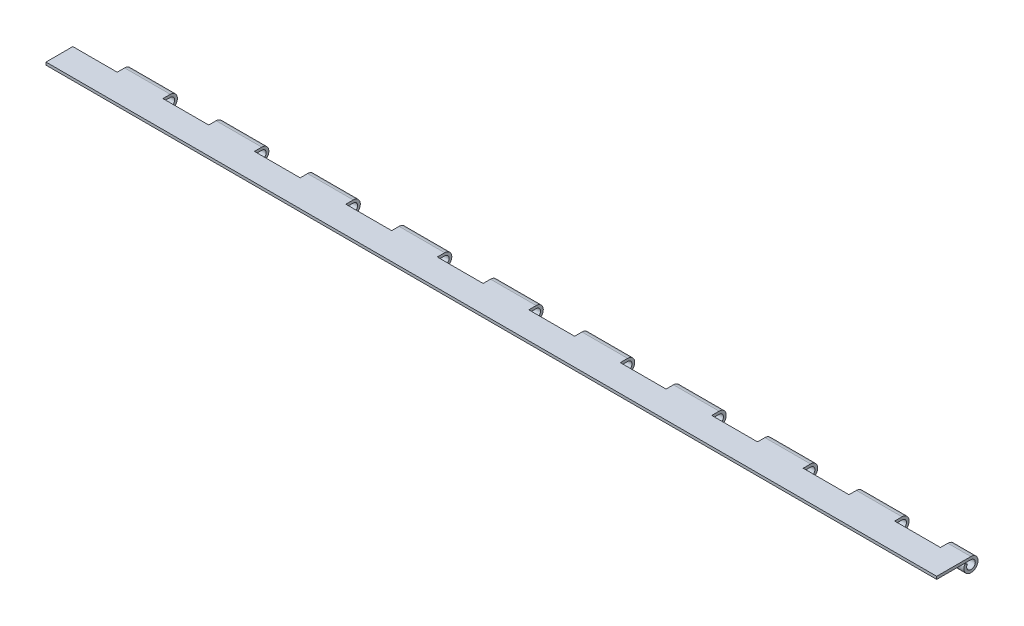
ISO-10303-21;
HEADER;
FILE_DESCRIPTION(('STEP AP214'),'2;1');
FILE_NAME('part.step','',(''),(''),'','','');
FILE_SCHEMA(('AUTOMOTIVE_DESIGN { 1 0 10303 214 1 1 1 1 }'));
ENDSEC;
DATA;
#1=APPLICATION_CONTEXT('core data for automotive mechanical design processes');
#2=APPLICATION_PROTOCOL_DEFINITION('international standard','automotive_design',2000,#1);
#3=PRODUCT_CONTEXT('',#1,'mechanical');
#4=PRODUCT('Part','Part','',(#3));
#5=PRODUCT_RELATED_PRODUCT_CATEGORY('part','',(#4));
#6=PRODUCT_DEFINITION_FORMATION('','',#4);
#7=PRODUCT_DEFINITION_CONTEXT('part definition',#1,'design');
#8=PRODUCT_DEFINITION('design','',#6,#7);
#9=PRODUCT_DEFINITION_SHAPE('','',#8);
#10=(LENGTH_UNIT() NAMED_UNIT(*) SI_UNIT(.MILLI.,.METRE.));
#11=(NAMED_UNIT(*) PLANE_ANGLE_UNIT() SI_UNIT($,.RADIAN.));
#12=(NAMED_UNIT(*) SI_UNIT($,.STERADIAN.) SOLID_ANGLE_UNIT());
#13=UNCERTAINTY_MEASURE_WITH_UNIT(LENGTH_MEASURE(1.E-05),#10,'distance_accuracy_value','');
#14=(GEOMETRIC_REPRESENTATION_CONTEXT(3) GLOBAL_UNCERTAINTY_ASSIGNED_CONTEXT((#13)) GLOBAL_UNIT_ASSIGNED_CONTEXT((#10,
#11,#12)) REPRESENTATION_CONTEXT('',''));
#15=CARTESIAN_POINT('',(0.,0.,0.));
#16=DIRECTION('',(0.,0.,1.));
#17=DIRECTION('',(1.,0.,0.));
#18=AXIS2_PLACEMENT_3D('',#15,#16,#17);
#19=CARTESIAN_POINT('',(1219.2,0.,0.));
#20=DIRECTION('',(-1.,0.,0.));
#21=DIRECTION('',(0.,0.,1.));
#22=AXIS2_PLACEMENT_3D('',#19,#20,#21);
#23=CYLINDRICAL_SURFACE('',#22,7.83050228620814);
#24=DIRECTION('',(-1.,0.,0.));
#25=VECTOR('',#24,1.);
#26=CARTESIAN_POINT('',(1219.2,4.04604553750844,6.70419880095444));
#27=LINE('',#26,#25);
#28=CARTESIAN_POINT('',(100.203000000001,4.04604553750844,6.70419880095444));
#29=VERTEX_POINT('',#28);
#30=CARTESIAN_POINT('',(49.4030000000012,4.04604553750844,6.70419880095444));
#31=VERTEX_POINT('',#30);
#32=EDGE_CURVE('E441',#29,#31,#27,.T.);
#33=ORIENTED_EDGE('',*,*,#32,.T.);
#34=CARTESIAN_POINT('',(49.4030000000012,0.,0.));
#35=DIRECTION('',(1.,0.,0.));
#36=DIRECTION('',(0.,0.,-1.));
#37=AXIS2_PLACEMENT_3D('',#34,#35,#36);
#38=CIRCLE('',#37,7.83050228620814);
#39=CARTESIAN_POINT('',(49.4030000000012,7.83050228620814,0.));
#40=VERTEX_POINT('',#39);
#41=EDGE_CURVE('E784',#31,#40,#38,.T.);
#42=ORIENTED_EDGE('',*,*,#41,.T.);
#43=DIRECTION('',(-1.,0.,0.));
#44=VECTOR('',#43,1.);
#45=CARTESIAN_POINT('',(1219.2,7.83050228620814,0.));
#46=LINE('',#45,#44);
#47=CARTESIAN_POINT('',(100.203000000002,7.83050228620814,0.));
#48=VERTEX_POINT('',#47);
#49=EDGE_CURVE('E444',#48,#40,#46,.T.);
#50=ORIENTED_EDGE('',*,*,#49,.F.);
#51=CARTESIAN_POINT('',(100.203000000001,0.,0.));
#52=DIRECTION('',(-1.,0.,0.));
#53=DIRECTION('',(0.,0.,1.));
#54=AXIS2_PLACEMENT_3D('',#51,#52,#53);
#55=CIRCLE('',#54,7.83050228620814);
#56=EDGE_CURVE('E763',#48,#29,#55,.T.);
#57=ORIENTED_EDGE('',*,*,#56,.T.);
#58=EDGE_LOOP('',(#33,#42,#50,#57));
#59=FACE_BOUND('',#58,.T.);
#60=ADVANCED_FACE('F31',(#59),#23,.T.);
#61=CARTESIAN_POINT('',(1219.2,0.,0.));
#62=DIRECTION('',(-1.,0.,0.));
#63=DIRECTION('',(0.,0.,1.));
#64=AXIS2_PLACEMENT_3D('',#61,#62,#63);
#65=CYLINDRICAL_SURFACE('',#64,4.78250228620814);
#66=DIRECTION('',(-1.,0.,0.));
#67=VECTOR('',#66,1.);
#68=CARTESIAN_POINT('',(1219.2,4.78250228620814,0.));
#69=LINE('',#68,#67);
#70=CARTESIAN_POINT('',(201.930000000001,4.78250228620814,0.));
#71=VERTEX_POINT('',#70);
#72=CARTESIAN_POINT('',(151.130000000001,4.78250228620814,0.));
#73=VERTEX_POINT('',#72);
#74=EDGE_CURVE('E826',#71,#73,#69,.T.);
#75=ORIENTED_EDGE('',*,*,#74,.T.);
#76=CARTESIAN_POINT('',(151.130000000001,0.,0.));
#77=DIRECTION('',(1.,0.,0.));
#78=DIRECTION('',(0.,0.,-1.));
#79=AXIS2_PLACEMENT_3D('',#76,#77,#78);
#80=CIRCLE('',#79,4.78250228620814);
#81=CARTESIAN_POINT('',(151.130000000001,2.47113420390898,4.09460912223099));
#82=VERTEX_POINT('',#81);
#83=EDGE_CURVE('E754',#73,#82,#80,.F.);
#84=ORIENTED_EDGE('',*,*,#83,.T.);
#85=DIRECTION('',(-1.,0.,0.));
#86=VECTOR('',#85,1.);
#87=CARTESIAN_POINT('',(1219.2,2.47113420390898,4.09460912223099));
#88=LINE('',#87,#86);
#89=CARTESIAN_POINT('',(201.930000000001,2.47113420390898,4.09460912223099));
#90=VERTEX_POINT('',#89);
#91=EDGE_CURVE('E897',#90,#82,#88,.T.);
#92=ORIENTED_EDGE('',*,*,#91,.F.);
#93=CARTESIAN_POINT('',(201.930000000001,0.,0.));
#94=DIRECTION('',(-1.,0.,0.));
#95=DIRECTION('',(0.,0.,1.));
#96=AXIS2_PLACEMENT_3D('',#93,#94,#95);
#97=CIRCLE('',#96,4.78250228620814);
#98=EDGE_CURVE('E733',#90,#71,#97,.F.);
#99=ORIENTED_EDGE('',*,*,#98,.T.);
#100=EDGE_LOOP('',(#75,#84,#92,#99));
#101=FACE_BOUND('',#100,.T.);
#102=ADVANCED_FACE('F941',(#101),#65,.F.);
#103=CARTESIAN_POINT('',(1219.2,2.47113420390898,4.09460912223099));
#104=DIRECTION('',(0.,-0.856164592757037,0.516703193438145));
#105=DIRECTION('',(0.,-0.516703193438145,-0.856164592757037));
#106=AXIS2_PLACEMENT_3D('',#103,#104,#105);
#107=PLANE('',#106);
#108=ORIENTED_EDGE('',*,*,#91,.T.);
#109=DIRECTION('',(0.,0.516703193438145,0.856164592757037));
#110=VECTOR('',#109,1.);
#111=CARTESIAN_POINT('',(151.130000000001,2.47113420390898,4.09460912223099));
#112=LINE('',#111,#110);
#113=CARTESIAN_POINT('',(151.130000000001,4.04604553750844,6.70419880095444));
#114=VERTEX_POINT('',#113);
#115=EDGE_CURVE('E757',#82,#114,#112,.T.);
#116=ORIENTED_EDGE('',*,*,#115,.T.);
#117=CARTESIAN_POINT('',(201.930000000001,4.04604553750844,6.70419880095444));
#118=VERTEX_POINT('',#117);
#119=EDGE_CURVE('E446',#118,#114,#27,.T.);
#120=ORIENTED_EDGE('',*,*,#119,.F.);
#121=DIRECTION('',(0.,-0.516703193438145,-0.856164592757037));
#122=VECTOR('',#121,1.);
#123=CARTESIAN_POINT('',(201.930000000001,2.47113420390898,4.09460912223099));
#124=LINE('',#123,#122);
#125=EDGE_CURVE('E736',#118,#90,#124,.T.);
#126=ORIENTED_EDGE('',*,*,#125,.T.);
#127=EDGE_LOOP('',(#108,#116,#120,#126));
#128=FACE_BOUND('',#127,.T.);
#129=ADVANCED_FACE('F937',(#128),#107,.F.);
#130=ORIENTED_EDGE('',*,*,#119,.T.);
#131=CARTESIAN_POINT('',(151.130000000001,0.,0.));
#132=DIRECTION('',(1.,0.,0.));
#133=DIRECTION('',(0.,0.,-1.));
#134=AXIS2_PLACEMENT_3D('',#131,#132,#133);
#135=CIRCLE('',#134,7.83050228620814);
#136=CARTESIAN_POINT('',(151.130000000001,7.83050228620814,0.));
#137=VERTEX_POINT('',#136);
#138=EDGE_CURVE('E749',#114,#137,#135,.T.);
#139=ORIENTED_EDGE('',*,*,#138,.T.);
#140=CARTESIAN_POINT('',(201.930000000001,7.83050228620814,0.));
#141=VERTEX_POINT('',#140);
#142=EDGE_CURVE('E453',#141,#137,#46,.T.);
#143=ORIENTED_EDGE('',*,*,#142,.F.);
#144=CARTESIAN_POINT('',(201.930000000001,0.,0.));
#145=DIRECTION('',(-1.,0.,0.));
#146=DIRECTION('',(0.,0.,1.));
#147=AXIS2_PLACEMENT_3D('',#144,#145,#146);
#148=CIRCLE('',#147,7.83050228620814);
#149=EDGE_CURVE('E728',#141,#118,#148,.T.);
#150=ORIENTED_EDGE('',*,*,#149,.T.);
#151=EDGE_LOOP('',(#130,#139,#143,#150));
#152=FACE_BOUND('',#151,.T.);
#153=ADVANCED_FACE('F960',(#152),#23,.T.);
#154=CARTESIAN_POINT('',(303.657000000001,4.78250228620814,0.));
#155=VERTEX_POINT('',#154);
#156=CARTESIAN_POINT('',(252.857000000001,4.78250228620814,0.));
#157=VERTEX_POINT('',#156);
#158=EDGE_CURVE('E830',#155,#157,#69,.T.);
#159=ORIENTED_EDGE('',*,*,#158,.T.);
#160=CARTESIAN_POINT('',(252.857000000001,0.,0.));
#161=DIRECTION('',(1.,0.,0.));
#162=DIRECTION('',(0.,0.,-1.));
#163=AXIS2_PLACEMENT_3D('',#160,#161,#162);
#164=CIRCLE('',#163,4.78250228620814);
#165=CARTESIAN_POINT('',(252.857000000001,2.47113420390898,4.09460912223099));
#166=VERTEX_POINT('',#165);
#167=EDGE_CURVE('E719',#157,#166,#164,.F.);
#168=ORIENTED_EDGE('',*,*,#167,.T.);
#169=CARTESIAN_POINT('',(303.657000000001,2.47113420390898,4.09460912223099));
#170=VERTEX_POINT('',#169);
#171=EDGE_CURVE('E889',#170,#166,#88,.T.);
#172=ORIENTED_EDGE('',*,*,#171,.F.);
#173=CARTESIAN_POINT('',(303.657000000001,0.,0.));
#174=DIRECTION('',(-1.,0.,0.));
#175=DIRECTION('',(0.,0.,1.));
#176=AXIS2_PLACEMENT_3D('',#173,#174,#175);
#177=CIRCLE('',#176,4.78250228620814);
#178=EDGE_CURVE('E698',#170,#155,#177,.F.);
#179=ORIENTED_EDGE('',*,*,#178,.T.);
#180=EDGE_LOOP('',(#159,#168,#172,#179));
#181=FACE_BOUND('',#180,.T.);
#182=ADVANCED_FACE('F867',(#181),#65,.F.);
#183=ORIENTED_EDGE('',*,*,#171,.T.);
#184=DIRECTION('',(0.,0.516703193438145,0.856164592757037));
#185=VECTOR('',#184,1.);
#186=CARTESIAN_POINT('',(252.857000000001,2.47113420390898,4.09460912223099));
#187=LINE('',#186,#185);
#188=CARTESIAN_POINT('',(252.857000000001,4.04604553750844,6.70419880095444));
#189=VERTEX_POINT('',#188);
#190=EDGE_CURVE('E722',#166,#189,#187,.T.);
#191=ORIENTED_EDGE('',*,*,#190,.T.);
#192=CARTESIAN_POINT('',(303.657000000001,4.04604553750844,6.70419880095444));
#193=VERTEX_POINT('',#192);
#194=EDGE_CURVE('E888',#193,#189,#27,.T.);
#195=ORIENTED_EDGE('',*,*,#194,.F.);
#196=DIRECTION('',(0.,-0.516703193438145,-0.856164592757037));
#197=VECTOR('',#196,1.);
#198=CARTESIAN_POINT('',(303.657000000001,2.47113420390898,4.09460912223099));
#199=LINE('',#198,#197);
#200=EDGE_CURVE('E701',#193,#170,#199,.T.);
#201=ORIENTED_EDGE('',*,*,#200,.T.);
#202=EDGE_LOOP('',(#183,#191,#195,#201));
#203=FACE_BOUND('',#202,.T.);
#204=ADVANCED_FACE('F887',(#203),#107,.F.);
#205=ORIENTED_EDGE('',*,*,#194,.T.);
#206=CARTESIAN_POINT('',(252.857000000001,0.,0.));
#207=DIRECTION('',(1.,0.,0.));
#208=DIRECTION('',(0.,0.,-1.));
#209=AXIS2_PLACEMENT_3D('',#206,#207,#208);
#210=CIRCLE('',#209,7.83050228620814);
#211=CARTESIAN_POINT('',(252.857000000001,7.83050228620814,0.));
#212=VERTEX_POINT('',#211);
#213=EDGE_CURVE('E714',#189,#212,#210,.T.);
#214=ORIENTED_EDGE('',*,*,#213,.T.);
#215=CARTESIAN_POINT('',(303.657000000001,7.83050228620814,0.));
#216=VERTEX_POINT('',#215);
#217=EDGE_CURVE('E458',#216,#212,#46,.T.);
#218=ORIENTED_EDGE('',*,*,#217,.F.);
#219=CARTESIAN_POINT('',(303.657000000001,0.,0.));
#220=DIRECTION('',(-1.,0.,0.));
#221=DIRECTION('',(0.,0.,1.));
#222=AXIS2_PLACEMENT_3D('',#219,#220,#221);
#223=CIRCLE('',#222,7.83050228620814);
#224=EDGE_CURVE('E693',#216,#193,#223,.T.);
#225=ORIENTED_EDGE('',*,*,#224,.T.);
#226=EDGE_LOOP('',(#205,#214,#218,#225));
#227=FACE_BOUND('',#226,.T.);
#228=ADVANCED_FACE('F890',(#227),#23,.T.);
#229=CARTESIAN_POINT('',(405.384000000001,4.78250228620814,0.));
#230=VERTEX_POINT('',#229);
#231=CARTESIAN_POINT('',(354.584000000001,4.78250228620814,0.));
#232=VERTEX_POINT('',#231);
#233=EDGE_CURVE('E858',#230,#232,#69,.T.);
#234=ORIENTED_EDGE('',*,*,#233,.T.);
#235=CARTESIAN_POINT('',(354.584000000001,0.,0.));
#236=DIRECTION('',(1.,0.,0.));
#237=DIRECTION('',(0.,0.,-1.));
#238=AXIS2_PLACEMENT_3D('',#235,#236,#237);
#239=CIRCLE('',#238,4.78250228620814);
#240=CARTESIAN_POINT('',(354.584000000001,2.47113420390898,4.09460912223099));
#241=VERTEX_POINT('',#240);
#242=EDGE_CURVE('E684',#232,#241,#239,.F.);
#243=ORIENTED_EDGE('',*,*,#242,.T.);
#244=CARTESIAN_POINT('',(405.384000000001,2.47113420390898,4.09460912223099));
#245=VERTEX_POINT('',#244);
#246=EDGE_CURVE('E928',#245,#241,#88,.T.);
#247=ORIENTED_EDGE('',*,*,#246,.F.);
#248=CARTESIAN_POINT('',(405.384000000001,0.,0.));
#249=DIRECTION('',(-1.,0.,0.));
#250=DIRECTION('',(0.,0.,1.));
#251=AXIS2_PLACEMENT_3D('',#248,#249,#250);
#252=CIRCLE('',#251,4.78250228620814);
#253=EDGE_CURVE('E663',#245,#230,#252,.F.);
#254=ORIENTED_EDGE('',*,*,#253,.T.);
#255=EDGE_LOOP('',(#234,#243,#247,#254));
#256=FACE_BOUND('',#255,.T.);
#257=ADVANCED_FACE('F1094',(#256),#65,.F.);
#258=ORIENTED_EDGE('',*,*,#246,.T.);
#259=DIRECTION('',(0.,0.516703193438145,0.856164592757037));
#260=VECTOR('',#259,1.);
#261=CARTESIAN_POINT('',(354.584000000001,2.47113420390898,4.09460912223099));
#262=LINE('',#261,#260);
#263=CARTESIAN_POINT('',(354.584000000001,4.04604553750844,6.70419880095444));
#264=VERTEX_POINT('',#263);
#265=EDGE_CURVE('E687',#241,#264,#262,.T.);
#266=ORIENTED_EDGE('',*,*,#265,.T.);
#267=CARTESIAN_POINT('',(405.384000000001,4.04604553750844,6.70419880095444));
#268=VERTEX_POINT('',#267);
#269=EDGE_CURVE('E892',#268,#264,#27,.T.);
#270=ORIENTED_EDGE('',*,*,#269,.F.);
#271=DIRECTION('',(0.,-0.516703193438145,-0.856164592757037));
#272=VECTOR('',#271,1.);
#273=CARTESIAN_POINT('',(405.384000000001,2.47113420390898,4.09460912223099));
#274=LINE('',#273,#272);
#275=EDGE_CURVE('E666',#268,#245,#274,.T.);
#276=ORIENTED_EDGE('',*,*,#275,.T.);
#277=EDGE_LOOP('',(#258,#266,#270,#276));
#278=FACE_BOUND('',#277,.T.);
#279=ADVANCED_FACE('F1088',(#278),#107,.F.);
#280=ORIENTED_EDGE('',*,*,#269,.T.);
#281=CARTESIAN_POINT('',(354.584000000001,0.,0.));
#282=DIRECTION('',(1.,0.,0.));
#283=DIRECTION('',(0.,0.,-1.));
#284=AXIS2_PLACEMENT_3D('',#281,#282,#283);
#285=CIRCLE('',#284,7.83050228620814);
#286=CARTESIAN_POINT('',(354.584000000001,7.83050228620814,0.));
#287=VERTEX_POINT('',#286);
#288=EDGE_CURVE('E679',#264,#287,#285,.T.);
#289=ORIENTED_EDGE('',*,*,#288,.T.);
#290=CARTESIAN_POINT('',(405.384000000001,7.83050228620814,0.));
#291=VERTEX_POINT('',#290);
#292=EDGE_CURVE('E1000',#291,#287,#46,.T.);
#293=ORIENTED_EDGE('',*,*,#292,.F.);
#294=CARTESIAN_POINT('',(405.384000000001,0.,0.));
#295=DIRECTION('',(-1.,0.,0.));
#296=DIRECTION('',(0.,0.,1.));
#297=AXIS2_PLACEMENT_3D('',#294,#295,#296);
#298=CIRCLE('',#297,7.83050228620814);
#299=EDGE_CURVE('E658',#291,#268,#298,.T.);
#300=ORIENTED_EDGE('',*,*,#299,.T.);
#301=EDGE_LOOP('',(#280,#289,#293,#300));
#302=FACE_BOUND('',#301,.T.);
#303=ADVANCED_FACE('F1009',(#302),#23,.T.);
#304=CARTESIAN_POINT('',(507.111000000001,4.78250228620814,0.));
#305=VERTEX_POINT('',#304);
#306=CARTESIAN_POINT('',(456.311000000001,4.78250228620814,0.));
#307=VERTEX_POINT('',#306);
#308=EDGE_CURVE('E854',#305,#307,#69,.T.);
#309=ORIENTED_EDGE('',*,*,#308,.T.);
#310=CARTESIAN_POINT('',(456.311000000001,0.,0.));
#311=DIRECTION('',(1.,0.,0.));
#312=DIRECTION('',(0.,0.,-1.));
#313=AXIS2_PLACEMENT_3D('',#310,#311,#312);
#314=CIRCLE('',#313,4.78250228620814);
#315=CARTESIAN_POINT('',(456.311000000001,2.47113420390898,4.09460912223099));
#316=VERTEX_POINT('',#315);
#317=EDGE_CURVE('E649',#307,#316,#314,.F.);
#318=ORIENTED_EDGE('',*,*,#317,.T.);
#319=CARTESIAN_POINT('',(507.111000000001,2.47113420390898,4.09460912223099));
#320=VERTEX_POINT('',#319);
#321=EDGE_CURVE('E923',#320,#316,#88,.T.);
#322=ORIENTED_EDGE('',*,*,#321,.F.);
#323=CARTESIAN_POINT('',(507.111000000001,0.,0.));
#324=DIRECTION('',(-1.,0.,0.));
#325=DIRECTION('',(0.,0.,1.));
#326=AXIS2_PLACEMENT_3D('',#323,#324,#325);
#327=CIRCLE('',#326,4.78250228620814);
#328=EDGE_CURVE('E628',#320,#305,#327,.F.);
#329=ORIENTED_EDGE('',*,*,#328,.T.);
#330=EDGE_LOOP('',(#309,#318,#322,#329));
#331=FACE_BOUND('',#330,.T.);
#332=ADVANCED_FACE('F926',(#331),#65,.F.);
#333=ORIENTED_EDGE('',*,*,#321,.T.);
#334=DIRECTION('',(0.,0.516703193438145,0.856164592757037));
#335=VECTOR('',#334,1.);
#336=CARTESIAN_POINT('',(456.311000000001,2.47113420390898,4.09460912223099));
#337=LINE('',#336,#335);
#338=CARTESIAN_POINT('',(456.311000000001,4.04604553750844,6.70419880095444));
#339=VERTEX_POINT('',#338);
#340=EDGE_CURVE('E652',#316,#339,#337,.T.);
#341=ORIENTED_EDGE('',*,*,#340,.T.);
#342=CARTESIAN_POINT('',(507.111000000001,4.04604553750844,6.70419880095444));
#343=VERTEX_POINT('',#342);
#344=EDGE_CURVE('E894',#343,#339,#27,.T.);
#345=ORIENTED_EDGE('',*,*,#344,.F.);
#346=DIRECTION('',(0.,-0.516703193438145,-0.856164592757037));
#347=VECTOR('',#346,1.);
#348=CARTESIAN_POINT('',(507.111000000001,2.47113420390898,4.09460912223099));
#349=LINE('',#348,#347);
#350=EDGE_CURVE('E631',#343,#320,#349,.T.);
#351=ORIENTED_EDGE('',*,*,#350,.T.);
#352=EDGE_LOOP('',(#333,#341,#345,#351));
#353=FACE_BOUND('',#352,.T.);
#354=ADVANCED_FACE('F921',(#353),#107,.F.);
#355=ORIENTED_EDGE('',*,*,#344,.T.);
#356=CARTESIAN_POINT('',(456.311000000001,0.,0.));
#357=DIRECTION('',(1.,0.,0.));
#358=DIRECTION('',(0.,0.,-1.));
#359=AXIS2_PLACEMENT_3D('',#356,#357,#358);
#360=CIRCLE('',#359,7.83050228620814);
#361=CARTESIAN_POINT('',(456.311000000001,7.83050228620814,0.));
#362=VERTEX_POINT('',#361);
#363=EDGE_CURVE('E644',#339,#362,#360,.T.);
#364=ORIENTED_EDGE('',*,*,#363,.T.);
#365=CARTESIAN_POINT('',(507.111000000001,7.83050228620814,0.));
#366=VERTEX_POINT('',#365);
#367=EDGE_CURVE('E996',#366,#362,#46,.T.);
#368=ORIENTED_EDGE('',*,*,#367,.F.);
#369=CARTESIAN_POINT('',(507.111000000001,0.,0.));
#370=DIRECTION('',(-1.,0.,0.));
#371=DIRECTION('',(0.,0.,1.));
#372=AXIS2_PLACEMENT_3D('',#369,#370,#371);
#373=CIRCLE('',#372,7.83050228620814);
#374=EDGE_CURVE('E623',#366,#343,#373,.T.);
#375=ORIENTED_EDGE('',*,*,#374,.T.);
#376=EDGE_LOOP('',(#355,#364,#368,#375));
#377=FACE_BOUND('',#376,.T.);
#378=ADVANCED_FACE('F916',(#377),#23,.T.);
#379=CARTESIAN_POINT('',(608.838000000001,4.78250228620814,0.));
#380=VERTEX_POINT('',#379);
#381=CARTESIAN_POINT('',(558.038000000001,4.78250228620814,0.));
#382=VERTEX_POINT('',#381);
#383=EDGE_CURVE('E850',#380,#382,#69,.T.);
#384=ORIENTED_EDGE('',*,*,#383,.T.);
#385=CARTESIAN_POINT('',(558.038000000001,0.,0.));
#386=DIRECTION('',(1.,0.,0.));
#387=DIRECTION('',(0.,0.,-1.));
#388=AXIS2_PLACEMENT_3D('',#385,#386,#387);
#389=CIRCLE('',#388,4.78250228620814);
#390=CARTESIAN_POINT('',(558.038000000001,2.47113420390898,4.09460912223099));
#391=VERTEX_POINT('',#390);
#392=EDGE_CURVE('E614',#382,#391,#389,.F.);
#393=ORIENTED_EDGE('',*,*,#392,.T.);
#394=CARTESIAN_POINT('',(608.838000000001,2.47113420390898,4.09460912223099));
#395=VERTEX_POINT('',#394);
#396=EDGE_CURVE('E927',#395,#391,#88,.T.);
#397=ORIENTED_EDGE('',*,*,#396,.F.);
#398=CARTESIAN_POINT('',(608.838000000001,0.,0.));
#399=DIRECTION('',(-1.,0.,0.));
#400=DIRECTION('',(0.,0.,1.));
#401=AXIS2_PLACEMENT_3D('',#398,#399,#400);
#402=CIRCLE('',#401,4.78250228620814);
#403=EDGE_CURVE('E593',#395,#380,#402,.F.);
#404=ORIENTED_EDGE('',*,*,#403,.T.);
#405=EDGE_LOOP('',(#384,#393,#397,#404));
#406=FACE_BOUND('',#405,.T.);
#407=ADVANCED_FACE('F1081',(#406),#65,.F.);
#408=ORIENTED_EDGE('',*,*,#396,.T.);
#409=DIRECTION('',(0.,0.516703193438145,0.856164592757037));
#410=VECTOR('',#409,1.);
#411=CARTESIAN_POINT('',(558.038000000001,2.47113420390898,4.09460912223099));
#412=LINE('',#411,#410);
#413=CARTESIAN_POINT('',(558.038000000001,4.04604553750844,6.70419880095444));
#414=VERTEX_POINT('',#413);
#415=EDGE_CURVE('E617',#391,#414,#412,.T.);
#416=ORIENTED_EDGE('',*,*,#415,.T.);
#417=CARTESIAN_POINT('',(608.838000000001,4.04604553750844,6.70419880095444));
#418=VERTEX_POINT('',#417);
#419=EDGE_CURVE('E907',#418,#414,#27,.T.);
#420=ORIENTED_EDGE('',*,*,#419,.F.);
#421=DIRECTION('',(0.,-0.516703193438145,-0.856164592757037));
#422=VECTOR('',#421,1.);
#423=CARTESIAN_POINT('',(608.838000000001,2.47113420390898,4.09460912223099));
#424=LINE('',#423,#422);
#425=EDGE_CURVE('E596',#418,#395,#424,.T.);
#426=ORIENTED_EDGE('',*,*,#425,.T.);
#427=EDGE_LOOP('',(#408,#416,#420,#426));
#428=FACE_BOUND('',#427,.T.);
#429=ADVANCED_FACE('F1075',(#428),#107,.F.);
#430=ORIENTED_EDGE('',*,*,#419,.T.);
#431=CARTESIAN_POINT('',(558.038000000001,0.,0.));
#432=DIRECTION('',(1.,0.,0.));
#433=DIRECTION('',(0.,0.,-1.));
#434=AXIS2_PLACEMENT_3D('',#431,#432,#433);
#435=CIRCLE('',#434,7.83050228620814);
#436=CARTESIAN_POINT('',(558.038000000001,7.83050228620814,0.));
#437=VERTEX_POINT('',#436);
#438=EDGE_CURVE('E609',#414,#437,#435,.T.);
#439=ORIENTED_EDGE('',*,*,#438,.T.);
#440=CARTESIAN_POINT('',(608.838000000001,7.83050228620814,0.));
#441=VERTEX_POINT('',#440);
#442=EDGE_CURVE('E992',#441,#437,#46,.T.);
#443=ORIENTED_EDGE('',*,*,#442,.F.);
#444=CARTESIAN_POINT('',(608.838000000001,0.,0.));
#445=DIRECTION('',(-1.,0.,0.));
#446=DIRECTION('',(0.,0.,1.));
#447=AXIS2_PLACEMENT_3D('',#444,#445,#446);
#448=CIRCLE('',#447,7.83050228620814);
#449=EDGE_CURVE('E588',#441,#418,#448,.T.);
#450=ORIENTED_EDGE('',*,*,#449,.T.);
#451=EDGE_LOOP('',(#430,#439,#443,#450));
#452=FACE_BOUND('',#451,.T.);
#453=ADVANCED_FACE('F1068',(#452),#23,.T.);
#454=CARTESIAN_POINT('',(710.565000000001,4.78250228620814,0.));
#455=VERTEX_POINT('',#454);
#456=CARTESIAN_POINT('',(659.765000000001,4.78250228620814,0.));
#457=VERTEX_POINT('',#456);
#458=EDGE_CURVE('E846',#455,#457,#69,.T.);
#459=ORIENTED_EDGE('',*,*,#458,.T.);
#460=CARTESIAN_POINT('',(659.765000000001,0.,0.));
#461=DIRECTION('',(1.,0.,0.));
#462=DIRECTION('',(0.,0.,-1.));
#463=AXIS2_PLACEMENT_3D('',#460,#461,#462);
#464=CIRCLE('',#463,4.78250228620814);
#465=CARTESIAN_POINT('',(659.765000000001,2.47113420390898,4.09460912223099));
#466=VERTEX_POINT('',#465);
#467=EDGE_CURVE('E579',#457,#466,#464,.F.);
#468=ORIENTED_EDGE('',*,*,#467,.T.);
#469=CARTESIAN_POINT('',(710.565000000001,2.47113420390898,4.09460912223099));
#470=VERTEX_POINT('',#469);
#471=EDGE_CURVE('E930',#470,#466,#88,.T.);
#472=ORIENTED_EDGE('',*,*,#471,.F.);
#473=CARTESIAN_POINT('',(710.565000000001,0.,0.));
#474=DIRECTION('',(-1.,0.,0.));
#475=DIRECTION('',(0.,0.,1.));
#476=AXIS2_PLACEMENT_3D('',#473,#474,#475);
#477=CIRCLE('',#476,4.78250228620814);
#478=EDGE_CURVE('E558',#470,#455,#477,.F.);
#479=ORIENTED_EDGE('',*,*,#478,.T.);
#480=EDGE_LOOP('',(#459,#468,#472,#479));
#481=FACE_BOUND('',#480,.T.);
#482=ADVANCED_FACE('F1073',(#481),#65,.F.);
#483=ORIENTED_EDGE('',*,*,#471,.T.);
#484=DIRECTION('',(0.,0.516703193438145,0.856164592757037));
#485=VECTOR('',#484,1.);
#486=CARTESIAN_POINT('',(659.765000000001,2.47113420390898,4.09460912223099));
#487=LINE('',#486,#485);
#488=CARTESIAN_POINT('',(659.765000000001,4.04604553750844,6.70419880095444));
#489=VERTEX_POINT('',#488);
#490=EDGE_CURVE('E582',#466,#489,#487,.T.);
#491=ORIENTED_EDGE('',*,*,#490,.T.);
#492=CARTESIAN_POINT('',(710.565000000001,4.04604553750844,6.70419880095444));
#493=VERTEX_POINT('',#492);
#494=EDGE_CURVE('E903',#493,#489,#27,.T.);
#495=ORIENTED_EDGE('',*,*,#494,.F.);
#496=DIRECTION('',(0.,-0.516703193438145,-0.856164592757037));
#497=VECTOR('',#496,1.);
#498=CARTESIAN_POINT('',(710.565000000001,2.47113420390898,4.09460912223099));
#499=LINE('',#498,#497);
#500=EDGE_CURVE('E561',#493,#470,#499,.T.);
#501=ORIENTED_EDGE('',*,*,#500,.T.);
#502=EDGE_LOOP('',(#483,#491,#495,#501));
#503=FACE_BOUND('',#502,.T.);
#504=ADVANCED_FACE('F1066',(#503),#107,.F.);
#505=ORIENTED_EDGE('',*,*,#494,.T.);
#506=CARTESIAN_POINT('',(659.765000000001,0.,0.));
#507=DIRECTION('',(1.,0.,0.));
#508=DIRECTION('',(0.,0.,-1.));
#509=AXIS2_PLACEMENT_3D('',#506,#507,#508);
#510=CIRCLE('',#509,7.83050228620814);
#511=CARTESIAN_POINT('',(659.765000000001,7.83050228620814,0.));
#512=VERTEX_POINT('',#511);
#513=EDGE_CURVE('E574',#489,#512,#510,.T.);
#514=ORIENTED_EDGE('',*,*,#513,.T.);
#515=CARTESIAN_POINT('',(710.565000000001,7.83050228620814,0.));
#516=VERTEX_POINT('',#515);
#517=EDGE_CURVE('E990',#516,#512,#46,.T.);
#518=ORIENTED_EDGE('',*,*,#517,.F.);
#519=CARTESIAN_POINT('',(710.565000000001,0.,0.));
#520=DIRECTION('',(-1.,0.,0.));
#521=DIRECTION('',(0.,0.,1.));
#522=AXIS2_PLACEMENT_3D('',#519,#520,#521);
#523=CIRCLE('',#522,7.83050228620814);
#524=EDGE_CURVE('E553',#516,#493,#523,.T.);
#525=ORIENTED_EDGE('',*,*,#524,.T.);
#526=EDGE_LOOP('',(#505,#514,#518,#525));
#527=FACE_BOUND('',#526,.T.);
#528=ADVANCED_FACE('F1059',(#527),#23,.T.);
#529=CARTESIAN_POINT('',(812.292,4.78250228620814,0.));
#530=VERTEX_POINT('',#529);
#531=CARTESIAN_POINT('',(761.492000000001,4.78250228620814,0.));
#532=VERTEX_POINT('',#531);
#533=EDGE_CURVE('E842',#530,#532,#69,.T.);
#534=ORIENTED_EDGE('',*,*,#533,.T.);
#535=CARTESIAN_POINT('',(761.492000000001,0.,0.));
#536=DIRECTION('',(1.,0.,0.));
#537=DIRECTION('',(0.,0.,-1.));
#538=AXIS2_PLACEMENT_3D('',#535,#536,#537);
#539=CIRCLE('',#538,4.78250228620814);
#540=CARTESIAN_POINT('',(761.492000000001,2.47113420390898,4.09460912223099));
#541=VERTEX_POINT('',#540);
#542=EDGE_CURVE('E544',#532,#541,#539,.F.);
#543=ORIENTED_EDGE('',*,*,#542,.T.);
#544=CARTESIAN_POINT('',(812.292,2.47113420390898,4.09460912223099));
#545=VERTEX_POINT('',#544);
#546=EDGE_CURVE('E1581',#545,#541,#88,.T.);
#547=ORIENTED_EDGE('',*,*,#546,.F.);
#548=CARTESIAN_POINT('',(812.292,0.,0.));
#549=DIRECTION('',(-1.,0.,0.));
#550=DIRECTION('',(0.,0.,1.));
#551=AXIS2_PLACEMENT_3D('',#548,#549,#550);
#552=CIRCLE('',#551,4.78250228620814);
#553=EDGE_CURVE('E523',#545,#530,#552,.F.);
#554=ORIENTED_EDGE('',*,*,#553,.T.);
#555=EDGE_LOOP('',(#534,#543,#547,#554));
#556=FACE_BOUND('',#555,.T.);
#557=ADVANCED_FACE('F1064',(#556),#65,.F.);
#558=ORIENTED_EDGE('',*,*,#546,.T.);
#559=DIRECTION('',(0.,0.516703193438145,0.856164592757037));
#560=VECTOR('',#559,1.);
#561=CARTESIAN_POINT('',(761.492000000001,2.47113420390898,4.09460912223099));
#562=LINE('',#561,#560);
#563=CARTESIAN_POINT('',(761.492000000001,4.04604553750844,6.70419880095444));
#564=VERTEX_POINT('',#563);
#565=EDGE_CURVE('E547',#541,#564,#562,.T.);
#566=ORIENTED_EDGE('',*,*,#565,.T.);
#567=CARTESIAN_POINT('',(812.292,4.04604553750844,6.70419880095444));
#568=VERTEX_POINT('',#567);
#569=EDGE_CURVE('E899',#568,#564,#27,.T.);
#570=ORIENTED_EDGE('',*,*,#569,.F.);
#571=DIRECTION('',(0.,-0.516703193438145,-0.856164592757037));
#572=VECTOR('',#571,1.);
#573=CARTESIAN_POINT('',(812.292,2.47113420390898,4.09460912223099));
#574=LINE('',#573,#572);
#575=EDGE_CURVE('E526',#568,#545,#574,.T.);
#576=ORIENTED_EDGE('',*,*,#575,.T.);
#577=EDGE_LOOP('',(#558,#566,#570,#576));
#578=FACE_BOUND('',#577,.T.);
#579=ADVANCED_FACE('F1057',(#578),#107,.F.);
#580=ORIENTED_EDGE('',*,*,#569,.T.);
#581=CARTESIAN_POINT('',(761.492000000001,0.,0.));
#582=DIRECTION('',(1.,0.,0.));
#583=DIRECTION('',(0.,0.,-1.));
#584=AXIS2_PLACEMENT_3D('',#581,#582,#583);
#585=CIRCLE('',#584,7.83050228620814);
#586=CARTESIAN_POINT('',(761.492000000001,7.83050228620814,0.));
#587=VERTEX_POINT('',#586);
#588=EDGE_CURVE('E539',#564,#587,#585,.T.);
#589=ORIENTED_EDGE('',*,*,#588,.T.);
#590=CARTESIAN_POINT('',(812.292000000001,7.83050228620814,0.));
#591=VERTEX_POINT('',#590);
#592=EDGE_CURVE('E450',#591,#587,#46,.T.);
#593=ORIENTED_EDGE('',*,*,#592,.F.);
#594=CARTESIAN_POINT('',(812.292,0.,0.));
#595=DIRECTION('',(-1.,0.,0.));
#596=DIRECTION('',(0.,0.,1.));
#597=AXIS2_PLACEMENT_3D('',#594,#595,#596);
#598=CIRCLE('',#597,7.83050228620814);
#599=EDGE_CURVE('E518',#591,#568,#598,.T.);
#600=ORIENTED_EDGE('',*,*,#599,.T.);
#601=EDGE_LOOP('',(#580,#589,#593,#600));
#602=FACE_BOUND('',#601,.T.);
#603=ADVANCED_FACE('F988',(#602),#23,.T.);
#604=CARTESIAN_POINT('',(914.019,4.78250228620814,0.));
#605=VERTEX_POINT('',#604);
#606=CARTESIAN_POINT('',(863.219,4.78250228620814,0.));
#607=VERTEX_POINT('',#606);
#608=EDGE_CURVE('E836',#605,#607,#69,.T.);
#609=ORIENTED_EDGE('',*,*,#608,.T.);
#610=CARTESIAN_POINT('',(863.219,0.,0.));
#611=DIRECTION('',(1.,0.,0.));
#612=DIRECTION('',(0.,0.,-1.));
#613=AXIS2_PLACEMENT_3D('',#610,#611,#612);
#614=CIRCLE('',#613,4.78250228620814);
#615=CARTESIAN_POINT('',(863.219,2.47113420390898,4.09460912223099));
#616=VERTEX_POINT('',#615);
#617=EDGE_CURVE('E509',#607,#616,#614,.F.);
#618=ORIENTED_EDGE('',*,*,#617,.T.);
#619=CARTESIAN_POINT('',(914.019,2.47113420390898,4.09460912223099));
#620=VERTEX_POINT('',#619);
#621=EDGE_CURVE('E831',#620,#616,#88,.T.);
#622=ORIENTED_EDGE('',*,*,#621,.F.);
#623=CARTESIAN_POINT('',(914.019,0.,0.));
#624=DIRECTION('',(-1.,0.,0.));
#625=DIRECTION('',(0.,0.,1.));
#626=AXIS2_PLACEMENT_3D('',#623,#624,#625);
#627=CIRCLE('',#626,4.78250228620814);
#628=EDGE_CURVE('E489',#620,#605,#627,.F.);
#629=ORIENTED_EDGE('',*,*,#628,.T.);
#630=EDGE_LOOP('',(#609,#618,#622,#629));
#631=FACE_BOUND('',#630,.T.);
#632=ADVANCED_FACE('F1055',(#631),#65,.F.);
#633=ORIENTED_EDGE('',*,*,#621,.T.);
#634=DIRECTION('',(0.,0.516703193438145,0.856164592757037));
#635=VECTOR('',#634,1.);
#636=CARTESIAN_POINT('',(863.219,2.47113420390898,4.09460912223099));
#637=LINE('',#636,#635);
#638=CARTESIAN_POINT('',(863.219,4.04604553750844,6.70419880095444));
#639=VERTEX_POINT('',#638);
#640=EDGE_CURVE('E512',#616,#639,#637,.T.);
#641=ORIENTED_EDGE('',*,*,#640,.T.);
#642=CARTESIAN_POINT('',(914.019,4.04604553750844,6.70419880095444));
#643=VERTEX_POINT('',#642);
#644=EDGE_CURVE('E896',#643,#639,#27,.T.);
#645=ORIENTED_EDGE('',*,*,#644,.F.);
#646=DIRECTION('',(0.,-0.516703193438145,-0.856164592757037));
#647=VECTOR('',#646,1.);
#648=CARTESIAN_POINT('',(914.019,2.47113420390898,4.09460912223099));
#649=LINE('',#648,#647);
#650=EDGE_CURVE('E492',#643,#620,#649,.T.);
#651=ORIENTED_EDGE('',*,*,#650,.T.);
#652=EDGE_LOOP('',(#633,#641,#645,#651));
#653=FACE_BOUND('',#652,.T.);
#654=ADVANCED_FACE('F1049',(#653),#107,.F.);
#655=ORIENTED_EDGE('',*,*,#644,.T.);
#656=CARTESIAN_POINT('',(863.219,0.,0.));
#657=DIRECTION('',(1.,0.,0.));
#658=DIRECTION('',(0.,0.,-1.));
#659=AXIS2_PLACEMENT_3D('',#656,#657,#658);
#660=CIRCLE('',#659,7.83050228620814);
#661=CARTESIAN_POINT('',(863.219,7.83050228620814,0.));
#662=VERTEX_POINT('',#661);
#663=EDGE_CURVE('E504',#639,#662,#660,.T.);
#664=ORIENTED_EDGE('',*,*,#663,.T.);
#665=CARTESIAN_POINT('',(914.019,7.83050228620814,0.));
#666=VERTEX_POINT('',#665);
#667=EDGE_CURVE('E442',#666,#662,#46,.T.);
#668=ORIENTED_EDGE('',*,*,#667,.F.);
#669=CARTESIAN_POINT('',(914.019,0.,0.));
#670=DIRECTION('',(-1.,0.,0.));
#671=DIRECTION('',(0.,0.,1.));
#672=AXIS2_PLACEMENT_3D('',#669,#670,#671);
#673=CIRCLE('',#672,7.83050228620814);
#674=EDGE_CURVE('E484',#666,#643,#673,.T.);
#675=ORIENTED_EDGE('',*,*,#674,.T.);
#676=EDGE_LOOP('',(#655,#664,#668,#675));
#677=FACE_BOUND('',#676,.T.);
#678=ADVANCED_FACE('F1041',(#677),#23,.T.);
#679=CARTESIAN_POINT('',(990.6,2.47113420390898,4.09460912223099));
#680=VERTEX_POINT('',#679);
#681=CARTESIAN_POINT('',(964.946,2.47113420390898,4.09460912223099));
#682=VERTEX_POINT('',#681);
#683=EDGE_CURVE('E827',#680,#682,#88,.T.);
#684=ORIENTED_EDGE('',*,*,#683,.F.);
#685=CARTESIAN_POINT('',(990.6,0.,0.));
#686=DIRECTION('',(-1.,0.,0.));
#687=DIRECTION('',(0.,0.,1.));
#688=AXIS2_PLACEMENT_3D('',#685,#686,#687);
#689=CIRCLE('',#688,4.78250228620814);
#690=CARTESIAN_POINT('',(990.6,4.78250228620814,0.));
#691=VERTEX_POINT('',#690);
#692=EDGE_CURVE('E804',#680,#691,#689,.F.);
#693=ORIENTED_EDGE('',*,*,#692,.T.);
#694=CARTESIAN_POINT('',(964.946,4.78250228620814,0.));
#695=VERTEX_POINT('',#694);
#696=EDGE_CURVE('E812',#691,#695,#69,.T.);
#697=ORIENTED_EDGE('',*,*,#696,.T.);
#698=CARTESIAN_POINT('',(964.946,0.,0.));
#699=DIRECTION('',(1.,0.,0.));
#700=DIRECTION('',(0.,0.,-1.));
#701=AXIS2_PLACEMENT_3D('',#698,#699,#700);
#702=CIRCLE('',#701,4.78250228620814);
#703=EDGE_CURVE('E475',#695,#682,#702,.F.);
#704=ORIENTED_EDGE('',*,*,#703,.T.);
#705=EDGE_LOOP('',(#684,#693,#697,#704));
#706=FACE_BOUND('',#705,.T.);
#707=ADVANCED_FACE('F1046',(#706),#65,.F.);
#708=CARTESIAN_POINT('',(990.6,4.04604553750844,6.70419880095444));
#709=VERTEX_POINT('',#708);
#710=CARTESIAN_POINT('',(964.946,4.04604553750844,6.70419880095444));
#711=VERTEX_POINT('',#710);
#712=EDGE_CURVE('E448',#709,#711,#27,.T.);
#713=ORIENTED_EDGE('',*,*,#712,.F.);
#714=DIRECTION('',(0.,-0.516703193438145,-0.856164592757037));
#715=VECTOR('',#714,1.);
#716=CARTESIAN_POINT('',(990.6,2.47113420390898,4.09460912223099));
#717=LINE('',#716,#715);
#718=EDGE_CURVE('E421',#709,#680,#717,.T.);
#719=ORIENTED_EDGE('',*,*,#718,.T.);
#720=ORIENTED_EDGE('',*,*,#683,.T.);
#721=DIRECTION('',(0.,0.516703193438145,0.856164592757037));
#722=VECTOR('',#721,1.);
#723=CARTESIAN_POINT('',(964.946,2.47113420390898,4.09460912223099));
#724=LINE('',#723,#722);
#725=EDGE_CURVE('E478',#682,#711,#724,.T.);
#726=ORIENTED_EDGE('',*,*,#725,.T.);
#727=EDGE_LOOP('',(#713,#719,#720,#726));
#728=FACE_BOUND('',#727,.T.);
#729=ADVANCED_FACE('F1040',(#728),#107,.F.);
#730=CARTESIAN_POINT('',(990.6,7.83050228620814,0.));
#731=VERTEX_POINT('',#730);
#732=CARTESIAN_POINT('',(964.946,7.83050228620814,0.));
#733=VERTEX_POINT('',#732);
#734=EDGE_CURVE('E431',#731,#733,#46,.T.);
#735=ORIENTED_EDGE('',*,*,#734,.F.);
#736=CARTESIAN_POINT('',(990.6,0.,0.));
#737=DIRECTION('',(-1.,0.,0.));
#738=DIRECTION('',(0.,0.,1.));
#739=AXIS2_PLACEMENT_3D('',#736,#737,#738);
#740=CIRCLE('',#739,7.83050228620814);
#741=EDGE_CURVE('E418',#731,#709,#740,.T.);
#742=ORIENTED_EDGE('',*,*,#741,.T.);
#743=ORIENTED_EDGE('',*,*,#712,.T.);
#744=CARTESIAN_POINT('',(964.946,0.,0.));
#745=DIRECTION('',(1.,0.,0.));
#746=DIRECTION('',(0.,0.,-1.));
#747=AXIS2_PLACEMENT_3D('',#744,#745,#746);
#748=CIRCLE('',#747,7.83050228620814);
#749=EDGE_CURVE('E439',#711,#733,#748,.T.);
#750=ORIENTED_EDGE('',*,*,#749,.T.);
#751=EDGE_LOOP('',(#735,#742,#743,#750));
#752=FACE_BOUND('',#751,.T.);
#753=ADVANCED_FACE('F437',(#752),#23,.T.);
#754=CARTESIAN_POINT('',(1219.2,4.78250228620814,6.20035788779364));
#755=DIRECTION('',(0.,1.,0.));
#756=DIRECTION('',(0.,0.,1.));
#757=AXIS2_PLACEMENT_3D('',#754,#755,#756);
#758=PLANE('',#757);
#759=ORIENTED_EDGE('',*,*,#696,.F.);
#760=DIRECTION('',(0.,0.,1.));
#761=VECTOR('',#760,1.);
#762=CARTESIAN_POINT('',(990.6,4.78250228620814,6.20035788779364));
#763=LINE('',#762,#761);
#764=CARTESIAN_POINT('',(990.6,4.78250228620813,38.1));
#765=VERTEX_POINT('',#764);
#766=EDGE_CURVE('E435',#691,#765,#763,.T.);
#767=ORIENTED_EDGE('',*,*,#766,.T.);
#768=DIRECTION('',(-1.,0.,0.));
#769=VECTOR('',#768,1.);
#770=CARTESIAN_POINT('',(1219.2,4.78250228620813,38.1));
#771=LINE('',#770,#769);
#772=CARTESIAN_POINT('',(0.,4.78250228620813,38.1));
#773=VERTEX_POINT('',#772);
#774=EDGE_CURVE('E459',#765,#773,#771,.T.);
#775=ORIENTED_EDGE('',*,*,#774,.T.);
#776=DIRECTION('',(0.,0.,-1.));
#777=VECTOR('',#776,1.);
#778=CARTESIAN_POINT('',(0.,4.78250228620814,6.20035788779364));
#779=LINE('',#778,#777);
#780=CARTESIAN_POINT('',(0.,4.78250228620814,8.27873931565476));
#781=VERTEX_POINT('',#780);
#782=EDGE_CURVE('E468',#773,#781,#779,.T.);
#783=ORIENTED_EDGE('',*,*,#782,.T.);
#784=DIRECTION('',(1.,0.,0.));
#785=VECTOR('',#784,1.);
#786=CARTESIAN_POINT('',(1219.2,4.78250228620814,8.27873931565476));
#787=LINE('',#786,#785);
#788=CARTESIAN_POINT('',(49.4030000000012,4.78250228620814,8.27873931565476));
#789=VERTEX_POINT('',#788);
#790=EDGE_CURVE('E53',#781,#789,#787,.T.);
#791=ORIENTED_EDGE('',*,*,#790,.T.);
#792=DIRECTION('',(0.,0.,-1.));
#793=VECTOR('',#792,1.);
#794=CARTESIAN_POINT('',(49.4030000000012,4.78250228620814,6.20035788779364));
#795=LINE('',#794,#793);
#796=CARTESIAN_POINT('',(49.4030000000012,4.78250228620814,0.));
#797=VERTEX_POINT('',#796);
#798=EDGE_CURVE('E786',#789,#797,#795,.T.);
#799=ORIENTED_EDGE('',*,*,#798,.T.);
#800=CARTESIAN_POINT('',(100.203000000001,4.78250228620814,0.));
#801=VERTEX_POINT('',#800);
#802=EDGE_CURVE('E820',#801,#797,#69,.T.);
#803=ORIENTED_EDGE('',*,*,#802,.F.);
#804=DIRECTION('',(0.,0.,1.));
#805=VECTOR('',#804,1.);
#806=CARTESIAN_POINT('',(100.203000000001,4.78250228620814,6.20035788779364));
#807=LINE('',#806,#805);
#808=CARTESIAN_POINT('',(100.203000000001,4.78250228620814,8.27873931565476));
#809=VERTEX_POINT('',#808);
#810=EDGE_CURVE('E765',#801,#809,#807,.T.);
#811=ORIENTED_EDGE('',*,*,#810,.T.);
#812=DIRECTION('',(1.,0.,0.));
#813=VECTOR('',#812,1.);
#814=CARTESIAN_POINT('',(1219.2,4.78250228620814,8.27873931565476));
#815=LINE('',#814,#813);
#816=CARTESIAN_POINT('',(151.130000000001,4.78250228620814,8.27873931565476));
#817=VERTEX_POINT('',#816);
#818=EDGE_CURVE('E760',#809,#817,#815,.T.);
#819=ORIENTED_EDGE('',*,*,#818,.T.);
#820=DIRECTION('',(0.,0.,-1.));
#821=VECTOR('',#820,1.);
#822=CARTESIAN_POINT('',(151.130000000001,4.78250228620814,6.20035788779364));
#823=LINE('',#822,#821);
#824=EDGE_CURVE('E751',#817,#73,#823,.T.);
#825=ORIENTED_EDGE('',*,*,#824,.T.);
#826=ORIENTED_EDGE('',*,*,#74,.F.);
#827=DIRECTION('',(0.,0.,1.));
#828=VECTOR('',#827,1.);
#829=CARTESIAN_POINT('',(201.930000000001,4.78250228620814,6.20035788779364));
#830=LINE('',#829,#828);
#831=CARTESIAN_POINT('',(201.930000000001,4.78250228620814,8.27873931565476));
#832=VERTEX_POINT('',#831);
#833=EDGE_CURVE('E730',#71,#832,#830,.T.);
#834=ORIENTED_EDGE('',*,*,#833,.T.);
#835=DIRECTION('',(1.,0.,0.));
#836=VECTOR('',#835,1.);
#837=CARTESIAN_POINT('',(1219.2,4.78250228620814,8.27873931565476));
#838=LINE('',#837,#836);
#839=CARTESIAN_POINT('',(252.857000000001,4.78250228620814,8.27873931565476));
#840=VERTEX_POINT('',#839);
#841=EDGE_CURVE('E725',#832,#840,#838,.T.);
#842=ORIENTED_EDGE('',*,*,#841,.T.);
#843=DIRECTION('',(0.,0.,-1.));
#844=VECTOR('',#843,1.);
#845=CARTESIAN_POINT('',(252.857000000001,4.78250228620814,6.20035788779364));
#846=LINE('',#845,#844);
#847=EDGE_CURVE('E716',#840,#157,#846,.T.);
#848=ORIENTED_EDGE('',*,*,#847,.T.);
#849=ORIENTED_EDGE('',*,*,#158,.F.);
#850=DIRECTION('',(0.,0.,1.));
#851=VECTOR('',#850,1.);
#852=CARTESIAN_POINT('',(303.657000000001,4.78250228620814,6.20035788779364));
#853=LINE('',#852,#851);
#854=CARTESIAN_POINT('',(303.657000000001,4.78250228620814,8.27873931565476));
#855=VERTEX_POINT('',#854);
#856=EDGE_CURVE('E695',#155,#855,#853,.T.);
#857=ORIENTED_EDGE('',*,*,#856,.T.);
#858=DIRECTION('',(1.,0.,0.));
#859=VECTOR('',#858,1.);
#860=CARTESIAN_POINT('',(1219.2,4.78250228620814,8.27873931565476));
#861=LINE('',#860,#859);
#862=CARTESIAN_POINT('',(354.584000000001,4.78250228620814,8.27873931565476));
#863=VERTEX_POINT('',#862);
#864=EDGE_CURVE('E690',#855,#863,#861,.T.);
#865=ORIENTED_EDGE('',*,*,#864,.T.);
#866=DIRECTION('',(0.,0.,-1.));
#867=VECTOR('',#866,1.);
#868=CARTESIAN_POINT('',(354.584000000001,4.78250228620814,6.20035788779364));
#869=LINE('',#868,#867);
#870=EDGE_CURVE('E681',#863,#232,#869,.T.);
#871=ORIENTED_EDGE('',*,*,#870,.T.);
#872=ORIENTED_EDGE('',*,*,#233,.F.);
#873=DIRECTION('',(0.,0.,1.));
#874=VECTOR('',#873,1.);
#875=CARTESIAN_POINT('',(405.384000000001,4.78250228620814,6.20035788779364));
#876=LINE('',#875,#874);
#877=CARTESIAN_POINT('',(405.384000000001,4.78250228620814,8.27873931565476));
#878=VERTEX_POINT('',#877);
#879=EDGE_CURVE('E660',#230,#878,#876,.T.);
#880=ORIENTED_EDGE('',*,*,#879,.T.);
#881=DIRECTION('',(1.,0.,0.));
#882=VECTOR('',#881,1.);
#883=CARTESIAN_POINT('',(1219.2,4.78250228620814,8.27873931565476));
#884=LINE('',#883,#882);
#885=CARTESIAN_POINT('',(456.311000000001,4.78250228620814,8.27873931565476));
#886=VERTEX_POINT('',#885);
#887=EDGE_CURVE('E655',#878,#886,#884,.T.);
#888=ORIENTED_EDGE('',*,*,#887,.T.);
#889=DIRECTION('',(0.,0.,-1.));
#890=VECTOR('',#889,1.);
#891=CARTESIAN_POINT('',(456.311000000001,4.78250228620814,6.20035788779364));
#892=LINE('',#891,#890);
#893=EDGE_CURVE('E646',#886,#307,#892,.T.);
#894=ORIENTED_EDGE('',*,*,#893,.T.);
#895=ORIENTED_EDGE('',*,*,#308,.F.);
#896=DIRECTION('',(0.,0.,1.));
#897=VECTOR('',#896,1.);
#898=CARTESIAN_POINT('',(507.111000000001,4.78250228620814,6.20035788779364));
#899=LINE('',#898,#897);
#900=CARTESIAN_POINT('',(507.111000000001,4.78250228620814,8.27873931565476));
#901=VERTEX_POINT('',#900);
#902=EDGE_CURVE('E625',#305,#901,#899,.T.);
#903=ORIENTED_EDGE('',*,*,#902,.T.);
#904=DIRECTION('',(1.,0.,0.));
#905=VECTOR('',#904,1.);
#906=CARTESIAN_POINT('',(1219.2,4.78250228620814,8.27873931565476));
#907=LINE('',#906,#905);
#908=CARTESIAN_POINT('',(558.038000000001,4.78250228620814,8.27873931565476));
#909=VERTEX_POINT('',#908);
#910=EDGE_CURVE('E620',#901,#909,#907,.T.);
#911=ORIENTED_EDGE('',*,*,#910,.T.);
#912=DIRECTION('',(0.,0.,-1.));
#913=VECTOR('',#912,1.);
#914=CARTESIAN_POINT('',(558.038000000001,4.78250228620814,6.20035788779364));
#915=LINE('',#914,#913);
#916=EDGE_CURVE('E611',#909,#382,#915,.T.);
#917=ORIENTED_EDGE('',*,*,#916,.T.);
#918=ORIENTED_EDGE('',*,*,#383,.F.);
#919=DIRECTION('',(0.,0.,1.));
#920=VECTOR('',#919,1.);
#921=CARTESIAN_POINT('',(608.838000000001,4.78250228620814,6.20035788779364));
#922=LINE('',#921,#920);
#923=CARTESIAN_POINT('',(608.838000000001,4.78250228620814,8.27873931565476));
#924=VERTEX_POINT('',#923);
#925=EDGE_CURVE('E590',#380,#924,#922,.T.);
#926=ORIENTED_EDGE('',*,*,#925,.T.);
#927=DIRECTION('',(1.,0.,0.));
#928=VECTOR('',#927,1.);
#929=CARTESIAN_POINT('',(1219.2,4.78250228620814,8.27873931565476));
#930=LINE('',#929,#928);
#931=CARTESIAN_POINT('',(659.765000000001,4.78250228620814,8.27873931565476));
#932=VERTEX_POINT('',#931);
#933=EDGE_CURVE('E585',#924,#932,#930,.T.);
#934=ORIENTED_EDGE('',*,*,#933,.T.);
#935=DIRECTION('',(0.,0.,-1.));
#936=VECTOR('',#935,1.);
#937=CARTESIAN_POINT('',(659.765000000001,4.78250228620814,6.20035788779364));
#938=LINE('',#937,#936);
#939=EDGE_CURVE('E576',#932,#457,#938,.T.);
#940=ORIENTED_EDGE('',*,*,#939,.T.);
#941=ORIENTED_EDGE('',*,*,#458,.F.);
#942=DIRECTION('',(0.,0.,1.));
#943=VECTOR('',#942,1.);
#944=CARTESIAN_POINT('',(710.565000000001,4.78250228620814,6.20035788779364));
#945=LINE('',#944,#943);
#946=CARTESIAN_POINT('',(710.565000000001,4.78250228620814,8.27873931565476));
#947=VERTEX_POINT('',#946);
#948=EDGE_CURVE('E555',#455,#947,#945,.T.);
#949=ORIENTED_EDGE('',*,*,#948,.T.);
#950=DIRECTION('',(1.,0.,0.));
#951=VECTOR('',#950,1.);
#952=CARTESIAN_POINT('',(1219.2,4.78250228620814,8.27873931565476));
#953=LINE('',#952,#951);
#954=CARTESIAN_POINT('',(761.492000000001,4.78250228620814,8.27873931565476));
#955=VERTEX_POINT('',#954);
#956=EDGE_CURVE('E550',#947,#955,#953,.T.);
#957=ORIENTED_EDGE('',*,*,#956,.T.);
#958=DIRECTION('',(0.,0.,-1.));
#959=VECTOR('',#958,1.);
#960=CARTESIAN_POINT('',(761.492000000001,4.78250228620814,6.20035788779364));
#961=LINE('',#960,#959);
#962=EDGE_CURVE('E541',#955,#532,#961,.T.);
#963=ORIENTED_EDGE('',*,*,#962,.T.);
#964=ORIENTED_EDGE('',*,*,#533,.F.);
#965=DIRECTION('',(0.,0.,1.));
#966=VECTOR('',#965,1.);
#967=CARTESIAN_POINT('',(812.292,4.78250228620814,6.20035788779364));
#968=LINE('',#967,#966);
#969=CARTESIAN_POINT('',(812.292,4.78250228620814,8.27873931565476));
#970=VERTEX_POINT('',#969);
#971=EDGE_CURVE('E520',#530,#970,#968,.T.);
#972=ORIENTED_EDGE('',*,*,#971,.T.);
#973=DIRECTION('',(1.,0.,0.));
#974=VECTOR('',#973,1.);
#975=CARTESIAN_POINT('',(1219.2,4.78250228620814,8.27873931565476));
#976=LINE('',#975,#974);
#977=CARTESIAN_POINT('',(863.219,4.78250228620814,8.27873931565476));
#978=VERTEX_POINT('',#977);
#979=EDGE_CURVE('E515',#970,#978,#976,.T.);
#980=ORIENTED_EDGE('',*,*,#979,.T.);
#981=DIRECTION('',(0.,0.,-1.));
#982=VECTOR('',#981,1.);
#983=CARTESIAN_POINT('',(863.219,4.78250228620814,6.20035788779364));
#984=LINE('',#983,#982);
#985=EDGE_CURVE('E506',#978,#607,#984,.T.);
#986=ORIENTED_EDGE('',*,*,#985,.T.);
#987=ORIENTED_EDGE('',*,*,#608,.F.);
#988=DIRECTION('',(0.,0.,1.));
#989=VECTOR('',#988,1.);
#990=CARTESIAN_POINT('',(914.019,4.78250228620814,6.20035788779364));
#991=LINE('',#990,#989);
#992=CARTESIAN_POINT('',(914.019,4.78250228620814,8.27873931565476));
#993=VERTEX_POINT('',#992);
#994=EDGE_CURVE('E486',#605,#993,#991,.T.);
#995=ORIENTED_EDGE('',*,*,#994,.T.);
#996=DIRECTION('',(1.,0.,0.));
#997=VECTOR('',#996,1.);
#998=CARTESIAN_POINT('',(1219.2,4.78250228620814,8.27873931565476));
#999=LINE('',#998,#997);
#1000=CARTESIAN_POINT('',(964.946,4.78250228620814,8.27873931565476));
#1001=VERTEX_POINT('',#1000);
#1002=EDGE_CURVE('E481',#993,#1001,#999,.T.);
#1003=ORIENTED_EDGE('',*,*,#1002,.T.);
#1004=DIRECTION('',(0.,0.,-1.));
#1005=VECTOR('',#1004,1.);
#1006=CARTESIAN_POINT('',(964.946,4.78250228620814,6.20035788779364));
#1007=LINE('',#1006,#1005);
#1008=EDGE_CURVE('E472',#1001,#695,#1007,.T.);
#1009=ORIENTED_EDGE('',*,*,#1008,.T.);
#1010=EDGE_LOOP('',(#759,#767,#775,#783,#791,#799,#803,#811,#819,#825,#826,#834,#842,#848,#849,
#857,#865,#871,#872,#880,#888,#894,#895,#903,#911,#917,#918,#926,#934,#940,#941,#949,#957,#963,
#964,#972,#980,#986,#987,#995,#1003,#1009));
#1011=FACE_BOUND('',#1010,.T.);
#1012=ADVANCED_FACE('F33',(#1011),#758,.F.);
#1013=ORIENTED_EDGE('',*,*,#802,.T.);
#1014=CARTESIAN_POINT('',(49.4030000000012,0.,0.));
#1015=DIRECTION('',(1.,0.,0.));
#1016=DIRECTION('',(0.,0.,-1.));
#1017=AXIS2_PLACEMENT_3D('',#1014,#1015,#1016);
#1018=CIRCLE('',#1017,4.78250228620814);
#1019=CARTESIAN_POINT('',(49.4030000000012,2.47113420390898,4.09460912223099));
#1020=VERTEX_POINT('',#1019);
#1021=EDGE_CURVE('E789',#797,#1020,#1018,.F.);
#1022=ORIENTED_EDGE('',*,*,#1021,.T.);
#1023=CARTESIAN_POINT('',(100.203000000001,2.47113420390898,4.09460912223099));
#1024=VERTEX_POINT('',#1023);
#1025=EDGE_CURVE('E833',#1024,#1020,#88,.T.);
#1026=ORIENTED_EDGE('',*,*,#1025,.F.);
#1027=CARTESIAN_POINT('',(100.203000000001,0.,0.));
#1028=DIRECTION('',(-1.,0.,0.));
#1029=DIRECTION('',(0.,0.,1.));
#1030=AXIS2_PLACEMENT_3D('',#1027,#1028,#1029);
#1031=CIRCLE('',#1030,4.78250228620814);
#1032=EDGE_CURVE('E768',#1024,#801,#1031,.F.);
#1033=ORIENTED_EDGE('',*,*,#1032,.T.);
#1034=EDGE_LOOP('',(#1013,#1022,#1026,#1033));
#1035=FACE_BOUND('',#1034,.T.);
#1036=ADVANCED_FACE('F823',(#1035),#65,.F.);
#1037=ORIENTED_EDGE('',*,*,#1025,.T.);
#1038=DIRECTION('',(0.,0.516703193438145,0.856164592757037));
#1039=VECTOR('',#1038,1.);
#1040=CARTESIAN_POINT('',(49.4030000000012,2.47113420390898,4.09460912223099));
#1041=LINE('',#1040,#1039);
#1042=EDGE_CURVE('E792',#1020,#31,#1041,.T.);
#1043=ORIENTED_EDGE('',*,*,#1042,.T.);
#1044=ORIENTED_EDGE('',*,*,#32,.F.);
#1045=DIRECTION('',(0.,-0.516703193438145,-0.856164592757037));
#1046=VECTOR('',#1045,1.);
#1047=CARTESIAN_POINT('',(100.203000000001,2.47113420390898,4.09460912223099));
#1048=LINE('',#1047,#1046);
#1049=EDGE_CURVE('E771',#29,#1024,#1048,.T.);
#1050=ORIENTED_EDGE('',*,*,#1049,.T.);
#1051=EDGE_LOOP('',(#1037,#1043,#1044,#1050));
#1052=FACE_BOUND('',#1051,.T.);
#1053=ADVANCED_FACE('F1048',(#1052),#107,.F.);
#1054=CARTESIAN_POINT('',(1219.2,7.83050228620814,0.));
#1055=DIRECTION('',(0.,-1.,0.));
#1056=DIRECTION('',(0.,0.,-1.));
#1057=AXIS2_PLACEMENT_3D('',#1054,#1055,#1056);
#1058=PLANE('',#1057);
#1059=DIRECTION('',(-1.,0.,0.));
#1060=VECTOR('',#1059,1.);
#1061=CARTESIAN_POINT('',(1219.2,7.83050228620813,38.1));
#1062=LINE('',#1061,#1060);
#1063=CARTESIAN_POINT('',(990.6,7.83050228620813,38.1));
#1064=VERTEX_POINT('',#1063);
#1065=CARTESIAN_POINT('',(0.,7.83050228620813,38.1));
#1066=VERTEX_POINT('',#1065);
#1067=EDGE_CURVE('E434',#1064,#1066,#1062,.T.);
#1068=ORIENTED_EDGE('',*,*,#1067,.F.);
#1069=DIRECTION('',(0.,0.,1.));
#1070=VECTOR('',#1069,1.);
#1071=CARTESIAN_POINT('',(990.6,7.83050228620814,-35.9636831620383));
#1072=LINE('',#1071,#1070);
#1073=EDGE_CURVE('E46',#731,#1064,#1072,.T.);
#1074=ORIENTED_EDGE('',*,*,#1073,.F.);
#1075=ORIENTED_EDGE('',*,*,#734,.T.);
#1076=DIRECTION('',(0.,0.,-1.));
#1077=VECTOR('',#1076,1.);
#1078=CARTESIAN_POINT('',(964.946,7.83050228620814,-16.1473874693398));
#1079=LINE('',#1078,#1077);
#1080=CARTESIAN_POINT('',(964.946,7.83050228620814,8.27873931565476));
#1081=VERTEX_POINT('',#1080);
#1082=EDGE_CURVE('E502',#1081,#733,#1079,.T.);
#1083=ORIENTED_EDGE('',*,*,#1082,.F.);
#1084=DIRECTION('',(1.,0.,0.));
#1085=VECTOR('',#1084,1.);
#1086=CARTESIAN_POINT('',(964.946,7.83050228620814,8.27873931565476));
#1087=LINE('',#1086,#1085);
#1088=CARTESIAN_POINT('',(914.019,7.83050228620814,8.27873931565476));
#1089=VERTEX_POINT('',#1088);
#1090=EDGE_CURVE('E498',#1089,#1081,#1087,.T.);
#1091=ORIENTED_EDGE('',*,*,#1090,.F.);
#1092=DIRECTION('',(0.,0.,-1.));
#1093=VECTOR('',#1092,1.);
#1094=CARTESIAN_POINT('',(914.019,7.83050228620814,0.));
#1095=LINE('',#1094,#1093);
#1096=EDGE_CURVE('E835',#1089,#666,#1095,.T.);
#1097=ORIENTED_EDGE('',*,*,#1096,.T.);
#1098=ORIENTED_EDGE('',*,*,#667,.T.);
#1099=DIRECTION('',(0.,0.,-1.));
#1100=VECTOR('',#1099,1.);
#1101=CARTESIAN_POINT('',(863.219,7.83050228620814,-16.1473874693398));
#1102=LINE('',#1101,#1100);
#1103=CARTESIAN_POINT('',(863.219,7.83050228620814,8.27873931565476));
#1104=VERTEX_POINT('',#1103);
#1105=EDGE_CURVE('E536',#1104,#662,#1102,.T.);
#1106=ORIENTED_EDGE('',*,*,#1105,.F.);
#1107=DIRECTION('',(1.,0.,0.));
#1108=VECTOR('',#1107,1.);
#1109=CARTESIAN_POINT('',(863.219,7.83050228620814,8.27873931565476));
#1110=LINE('',#1109,#1108);
#1111=CARTESIAN_POINT('',(812.292,7.83050228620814,8.27873931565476));
#1112=VERTEX_POINT('',#1111);
#1113=EDGE_CURVE('E532',#1112,#1104,#1110,.T.);
#1114=ORIENTED_EDGE('',*,*,#1113,.F.);
#1115=DIRECTION('',(0.,0.,-1.));
#1116=VECTOR('',#1115,1.);
#1117=CARTESIAN_POINT('',(812.292,7.83050228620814,0.));
#1118=LINE('',#1117,#1116);
#1119=EDGE_CURVE('E840',#1112,#591,#1118,.T.);
#1120=ORIENTED_EDGE('',*,*,#1119,.T.);
#1121=ORIENTED_EDGE('',*,*,#592,.T.);
#1122=DIRECTION('',(0.,0.,-1.));
#1123=VECTOR('',#1122,1.);
#1124=CARTESIAN_POINT('',(761.492000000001,7.83050228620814,-16.1473874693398));
#1125=LINE('',#1124,#1123);
#1126=CARTESIAN_POINT('',(761.492000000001,7.83050228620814,8.27873931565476));
#1127=VERTEX_POINT('',#1126);
#1128=EDGE_CURVE('E571',#1127,#587,#1125,.T.);
#1129=ORIENTED_EDGE('',*,*,#1128,.F.);
#1130=DIRECTION('',(1.,0.,0.));
#1131=VECTOR('',#1130,1.);
#1132=CARTESIAN_POINT('',(761.492000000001,7.83050228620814,8.27873931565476));
#1133=LINE('',#1132,#1131);
#1134=CARTESIAN_POINT('',(710.565000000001,7.83050228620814,8.27873931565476));
#1135=VERTEX_POINT('',#1134);
#1136=EDGE_CURVE('E567',#1135,#1127,#1133,.T.);
#1137=ORIENTED_EDGE('',*,*,#1136,.F.);
#1138=DIRECTION('',(0.,0.,-1.));
#1139=VECTOR('',#1138,1.);
#1140=CARTESIAN_POINT('',(710.565000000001,7.83050228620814,0.));
#1141=LINE('',#1140,#1139);
#1142=EDGE_CURVE('E976',#1135,#516,#1141,.T.);
#1143=ORIENTED_EDGE('',*,*,#1142,.T.);
#1144=ORIENTED_EDGE('',*,*,#517,.T.);
#1145=DIRECTION('',(0.,0.,-1.));
#1146=VECTOR('',#1145,1.);
#1147=CARTESIAN_POINT('',(659.765000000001,7.83050228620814,-16.1473874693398));
#1148=LINE('',#1147,#1146);
#1149=CARTESIAN_POINT('',(659.765000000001,7.83050228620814,8.27873931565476));
#1150=VERTEX_POINT('',#1149);
#1151=EDGE_CURVE('E606',#1150,#512,#1148,.T.);
#1152=ORIENTED_EDGE('',*,*,#1151,.F.);
#1153=DIRECTION('',(1.,0.,0.));
#1154=VECTOR('',#1153,1.);
#1155=CARTESIAN_POINT('',(659.765000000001,7.83050228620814,8.27873931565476));
#1156=LINE('',#1155,#1154);
#1157=CARTESIAN_POINT('',(608.838000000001,7.83050228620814,8.27873931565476));
#1158=VERTEX_POINT('',#1157);
#1159=EDGE_CURVE('E602',#1158,#1150,#1156,.T.);
#1160=ORIENTED_EDGE('',*,*,#1159,.F.);
#1161=DIRECTION('',(0.,0.,-1.));
#1162=VECTOR('',#1161,1.);
#1163=CARTESIAN_POINT('',(608.838000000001,7.83050228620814,0.));
#1164=LINE('',#1163,#1162);
#1165=EDGE_CURVE('E973',#1158,#441,#1164,.T.);
#1166=ORIENTED_EDGE('',*,*,#1165,.T.);
#1167=ORIENTED_EDGE('',*,*,#442,.T.);
#1168=DIRECTION('',(0.,0.,-1.));
#1169=VECTOR('',#1168,1.);
#1170=CARTESIAN_POINT('',(558.038000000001,7.83050228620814,-16.1473874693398));
#1171=LINE('',#1170,#1169);
#1172=CARTESIAN_POINT('',(558.038000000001,7.83050228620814,8.27873931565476));
#1173=VERTEX_POINT('',#1172);
#1174=EDGE_CURVE('E641',#1173,#437,#1171,.T.);
#1175=ORIENTED_EDGE('',*,*,#1174,.F.);
#1176=DIRECTION('',(1.,0.,0.));
#1177=VECTOR('',#1176,1.);
#1178=CARTESIAN_POINT('',(558.038000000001,7.83050228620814,8.27873931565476));
#1179=LINE('',#1178,#1177);
#1180=CARTESIAN_POINT('',(507.111000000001,7.83050228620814,8.27873931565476));
#1181=VERTEX_POINT('',#1180);
#1182=EDGE_CURVE('E637',#1181,#1173,#1179,.T.);
#1183=ORIENTED_EDGE('',*,*,#1182,.F.);
#1184=DIRECTION('',(0.,0.,-1.));
#1185=VECTOR('',#1184,1.);
#1186=CARTESIAN_POINT('',(507.111000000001,7.83050228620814,0.));
#1187=LINE('',#1186,#1185);
#1188=EDGE_CURVE('E970',#1181,#366,#1187,.T.);
#1189=ORIENTED_EDGE('',*,*,#1188,.T.);
#1190=ORIENTED_EDGE('',*,*,#367,.T.);
#1191=DIRECTION('',(0.,0.,-1.));
#1192=VECTOR('',#1191,1.);
#1193=CARTESIAN_POINT('',(456.311000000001,7.83050228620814,-16.1473874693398));
#1194=LINE('',#1193,#1192);
#1195=CARTESIAN_POINT('',(456.311000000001,7.83050228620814,8.27873931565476));
#1196=VERTEX_POINT('',#1195);
#1197=EDGE_CURVE('E676',#1196,#362,#1194,.T.);
#1198=ORIENTED_EDGE('',*,*,#1197,.F.);
#1199=DIRECTION('',(1.,0.,0.));
#1200=VECTOR('',#1199,1.);
#1201=CARTESIAN_POINT('',(456.311000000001,7.83050228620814,8.27873931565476));
#1202=LINE('',#1201,#1200);
#1203=CARTESIAN_POINT('',(405.384000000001,7.83050228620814,8.27873931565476));
#1204=VERTEX_POINT('',#1203);
#1205=EDGE_CURVE('E672',#1204,#1196,#1202,.T.);
#1206=ORIENTED_EDGE('',*,*,#1205,.F.);
#1207=DIRECTION('',(0.,0.,-1.));
#1208=VECTOR('',#1207,1.);
#1209=CARTESIAN_POINT('',(405.384000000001,7.83050228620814,0.));
#1210=LINE('',#1209,#1208);
#1211=EDGE_CURVE('E965',#1204,#291,#1210,.T.);
#1212=ORIENTED_EDGE('',*,*,#1211,.T.);
#1213=ORIENTED_EDGE('',*,*,#292,.T.);
#1214=DIRECTION('',(0.,0.,-1.));
#1215=VECTOR('',#1214,1.);
#1216=CARTESIAN_POINT('',(354.584000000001,7.83050228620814,-16.1473874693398));
#1217=LINE('',#1216,#1215);
#1218=CARTESIAN_POINT('',(354.584000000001,7.83050228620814,8.27873931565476));
#1219=VERTEX_POINT('',#1218);
#1220=EDGE_CURVE('E711',#1219,#287,#1217,.T.);
#1221=ORIENTED_EDGE('',*,*,#1220,.F.);
#1222=DIRECTION('',(1.,0.,0.));
#1223=VECTOR('',#1222,1.);
#1224=CARTESIAN_POINT('',(354.584000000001,7.83050228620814,8.27873931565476));
#1225=LINE('',#1224,#1223);
#1226=CARTESIAN_POINT('',(303.657000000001,7.83050228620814,8.27873931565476));
#1227=VERTEX_POINT('',#1226);
#1228=EDGE_CURVE('E707',#1227,#1219,#1225,.T.);
#1229=ORIENTED_EDGE('',*,*,#1228,.F.);
#1230=DIRECTION('',(0.,0.,-1.));
#1231=VECTOR('',#1230,1.);
#1232=CARTESIAN_POINT('',(303.657000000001,7.83050228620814,0.));
#1233=LINE('',#1232,#1231);
#1234=EDGE_CURVE('E963',#1227,#216,#1233,.T.);
#1235=ORIENTED_EDGE('',*,*,#1234,.T.);
#1236=ORIENTED_EDGE('',*,*,#217,.T.);
#1237=DIRECTION('',(0.,0.,-1.));
#1238=VECTOR('',#1237,1.);
#1239=CARTESIAN_POINT('',(252.857000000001,7.83050228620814,-16.1473874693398));
#1240=LINE('',#1239,#1238);
#1241=CARTESIAN_POINT('',(252.857000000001,7.83050228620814,8.27873931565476));
#1242=VERTEX_POINT('',#1241);
#1243=EDGE_CURVE('E746',#1242,#212,#1240,.T.);
#1244=ORIENTED_EDGE('',*,*,#1243,.F.);
#1245=DIRECTION('',(1.,0.,0.));
#1246=VECTOR('',#1245,1.);
#1247=CARTESIAN_POINT('',(252.857000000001,7.83050228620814,8.27873931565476));
#1248=LINE('',#1247,#1246);
#1249=CARTESIAN_POINT('',(201.930000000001,7.83050228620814,8.27873931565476));
#1250=VERTEX_POINT('',#1249);
#1251=EDGE_CURVE('E742',#1250,#1242,#1248,.T.);
#1252=ORIENTED_EDGE('',*,*,#1251,.F.);
#1253=DIRECTION('',(0.,0.,-1.));
#1254=VECTOR('',#1253,1.);
#1255=CARTESIAN_POINT('',(201.930000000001,7.83050228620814,0.));
#1256=LINE('',#1255,#1254);
#1257=EDGE_CURVE('E955',#1250,#141,#1256,.T.);
#1258=ORIENTED_EDGE('',*,*,#1257,.T.);
#1259=ORIENTED_EDGE('',*,*,#142,.T.);
#1260=DIRECTION('',(0.,0.,-1.));
#1261=VECTOR('',#1260,1.);
#1262=CARTESIAN_POINT('',(151.130000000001,7.83050228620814,-16.1473874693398));
#1263=LINE('',#1262,#1261);
#1264=CARTESIAN_POINT('',(151.130000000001,7.83050228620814,8.27873931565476));
#1265=VERTEX_POINT('',#1264);
#1266=EDGE_CURVE('E781',#1265,#137,#1263,.T.);
#1267=ORIENTED_EDGE('',*,*,#1266,.F.);
#1268=DIRECTION('',(1.,0.,0.));
#1269=VECTOR('',#1268,1.);
#1270=CARTESIAN_POINT('',(151.130000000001,7.83050228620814,8.27873931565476));
#1271=LINE('',#1270,#1269);
#1272=CARTESIAN_POINT('',(100.203000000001,7.83050228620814,8.27873931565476));
#1273=VERTEX_POINT('',#1272);
#1274=EDGE_CURVE('E777',#1273,#1265,#1271,.T.);
#1275=ORIENTED_EDGE('',*,*,#1274,.F.);
#1276=DIRECTION('',(0.,0.,-1.));
#1277=VECTOR('',#1276,1.);
#1278=CARTESIAN_POINT('',(100.203000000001,7.83050228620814,0.));
#1279=LINE('',#1278,#1277);
#1280=EDGE_CURVE('E952',#1273,#48,#1279,.T.);
#1281=ORIENTED_EDGE('',*,*,#1280,.T.);
#1282=ORIENTED_EDGE('',*,*,#49,.T.);
#1283=DIRECTION('',(0.,0.,-1.));
#1284=VECTOR('',#1283,1.);
#1285=CARTESIAN_POINT('',(49.4030000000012,7.83050228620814,-16.1473874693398));
#1286=LINE('',#1285,#1284);
#1287=CARTESIAN_POINT('',(49.4030000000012,7.83050228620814,8.27873931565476));
#1288=VERTEX_POINT('',#1287);
#1289=EDGE_CURVE('E425',#1288,#40,#1286,.T.);
#1290=ORIENTED_EDGE('',*,*,#1289,.F.);
#1291=DIRECTION('',(1.,0.,0.));
#1292=VECTOR('',#1291,1.);
#1293=CARTESIAN_POINT('',(49.4030000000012,7.83050228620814,8.27873931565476));
#1294=LINE('',#1293,#1292);
#1295=CARTESIAN_POINT('',(0.,7.83050228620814,8.27873931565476));
#1296=VERTEX_POINT('',#1295);
#1297=EDGE_CURVE('E798',#1296,#1288,#1294,.T.);
#1298=ORIENTED_EDGE('',*,*,#1297,.F.);
#1299=DIRECTION('',(0.,0.,1.));
#1300=VECTOR('',#1299,1.);
#1301=CARTESIAN_POINT('',(0.,7.83050228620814,0.));
#1302=LINE('',#1301,#1300);
#1303=EDGE_CURVE('E466',#1296,#1066,#1302,.T.);
#1304=ORIENTED_EDGE('',*,*,#1303,.T.);
#1305=EDGE_LOOP('',(#1068,#1074,#1075,#1083,#1091,#1097,#1098,#1106,#1114,#1120,#1121,#1129,
#1137,#1143,#1144,#1152,#1160,#1166,#1167,#1175,#1183,#1189,#1190,#1198,#1206,#1212,#1213,#1221,
#1229,#1235,#1236,#1244,#1252,#1258,#1259,#1267,#1275,#1281,#1282,#1290,#1298,#1304));
#1306=FACE_BOUND('',#1305,.T.);
#1307=ADVANCED_FACE('F429',(#1306),#1058,.F.);
#1308=CARTESIAN_POINT('',(1219.2,4.78250228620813,38.1));
#1309=DIRECTION('',(0.,0.,-1.));
#1310=DIRECTION('',(-1.,0.,0.));
#1311=AXIS2_PLACEMENT_3D('',#1308,#1309,#1310);
#1312=PLANE('',#1311);
#1313=ORIENTED_EDGE('',*,*,#774,.F.);
#1314=DIRECTION('',(0.,1.,0.));
#1315=VECTOR('',#1314,1.);
#1316=CARTESIAN_POINT('',(990.6,4.78250228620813,38.1));
#1317=LINE('',#1316,#1315);
#1318=EDGE_CURVE('E11',#765,#1064,#1317,.T.);
#1319=ORIENTED_EDGE('',*,*,#1318,.T.);
#1320=ORIENTED_EDGE('',*,*,#1067,.T.);
#1321=DIRECTION('',(0.,-1.,0.));
#1322=VECTOR('',#1321,1.);
#1323=CARTESIAN_POINT('',(0.,4.78250228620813,38.1));
#1324=LINE('',#1323,#1322);
#1325=EDGE_CURVE('E462',#1066,#773,#1324,.T.);
#1326=ORIENTED_EDGE('',*,*,#1325,.T.);
#1327=EDGE_LOOP('',(#1313,#1319,#1320,#1326));
#1328=FACE_BOUND('',#1327,.T.);
#1329=ADVANCED_FACE('F813',(#1328),#1312,.F.);
#1330=CARTESIAN_POINT('',(0.,0.,0.));
#1331=DIRECTION('',(1.,0.,0.));
#1332=DIRECTION('',(0.,0.,-1.));
#1333=AXIS2_PLACEMENT_3D('',#1330,#1331,#1332);
#1334=PLANE('',#1333);
#1335=ORIENTED_EDGE('',*,*,#1303,.F.);
#1336=DIRECTION('',(0.,-1.,0.));
#1337=VECTOR('',#1336,1.);
#1338=CARTESIAN_POINT('',(0.,0.,8.27873931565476));
#1339=LINE('',#1338,#1337);
#1340=EDGE_CURVE('E39',#1296,#781,#1339,.T.);
#1341=ORIENTED_EDGE('',*,*,#1340,.T.);
#1342=ORIENTED_EDGE('',*,*,#782,.F.);
#1343=ORIENTED_EDGE('',*,*,#1325,.F.);
#1344=EDGE_LOOP('',(#1335,#1341,#1342,#1343));
#1345=FACE_BOUND('',#1344,.T.);
#1346=ADVANCED_FACE('F817',(#1345),#1334,.F.);
#1347=CARTESIAN_POINT('',(964.946,-7.83050228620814,-16.1473874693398));
#1348=DIRECTION('',(1.,0.,0.));
#1349=DIRECTION('',(0.,0.,-1.));
#1350=AXIS2_PLACEMENT_3D('',#1347,#1348,#1349);
#1351=PLANE('',#1350);
#1352=ORIENTED_EDGE('',*,*,#749,.F.);
#1353=ORIENTED_EDGE('',*,*,#725,.F.);
#1354=ORIENTED_EDGE('',*,*,#703,.F.);
#1355=ORIENTED_EDGE('',*,*,#1008,.F.);
#1356=DIRECTION('',(0.,1.,0.));
#1357=VECTOR('',#1356,1.);
#1358=CARTESIAN_POINT('',(964.946,-7.83050228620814,8.27873931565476));
#1359=LINE('',#1358,#1357);
#1360=EDGE_CURVE('E495',#1001,#1081,#1359,.T.);
#1361=ORIENTED_EDGE('',*,*,#1360,.T.);
#1362=ORIENTED_EDGE('',*,*,#1082,.T.);
#1363=EDGE_LOOP('',(#1352,#1353,#1354,#1355,#1361,#1362));
#1364=FACE_BOUND('',#1363,.T.);
#1365=ADVANCED_FACE('F1214',(#1364),#1351,.F.);
#1366=CARTESIAN_POINT('',(964.946,-7.83050228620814,8.27873931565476));
#1367=DIRECTION('',(0.,0.,1.));
#1368=DIRECTION('',(0.,-1.,0.));
#1369=AXIS2_PLACEMENT_3D('',#1366,#1367,#1368);
#1370=PLANE('',#1369);
#1371=DIRECTION('',(0.,1.,0.));
#1372=VECTOR('',#1371,1.);
#1373=CARTESIAN_POINT('',(914.019,-7.83050228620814,8.27873931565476));
#1374=LINE('',#1373,#1372);
#1375=EDGE_CURVE('E496',#993,#1089,#1374,.T.);
#1376=ORIENTED_EDGE('',*,*,#1375,.T.);
#1377=ORIENTED_EDGE('',*,*,#1090,.T.);
#1378=ORIENTED_EDGE('',*,*,#1360,.F.);
#1379=ORIENTED_EDGE('',*,*,#1002,.F.);
#1380=EDGE_LOOP('',(#1376,#1377,#1378,#1379));
#1381=FACE_BOUND('',#1380,.T.);
#1382=ADVANCED_FACE('F1220',(#1381),#1370,.F.);
#1383=CARTESIAN_POINT('',(914.019,-7.83050228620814,-16.1473874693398));
#1384=DIRECTION('',(-1.,0.,0.));
#1385=DIRECTION('',(0.,0.,1.));
#1386=AXIS2_PLACEMENT_3D('',#1383,#1384,#1385);
#1387=PLANE('',#1386);
#1388=ORIENTED_EDGE('',*,*,#1096,.F.);
#1389=ORIENTED_EDGE('',*,*,#1375,.F.);
#1390=ORIENTED_EDGE('',*,*,#994,.F.);
#1391=ORIENTED_EDGE('',*,*,#628,.F.);
#1392=ORIENTED_EDGE('',*,*,#650,.F.);
#1393=ORIENTED_EDGE('',*,*,#674,.F.);
#1394=EDGE_LOOP('',(#1388,#1389,#1390,#1391,#1392,#1393));
#1395=FACE_BOUND('',#1394,.T.);
#1396=ADVANCED_FACE('F1228',(#1395),#1387,.F.);
#1397=CARTESIAN_POINT('',(863.219,-7.83050228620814,-16.1473874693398));
#1398=DIRECTION('',(1.,0.,0.));
#1399=DIRECTION('',(0.,0.,-1.));
#1400=AXIS2_PLACEMENT_3D('',#1397,#1398,#1399);
#1401=PLANE('',#1400);
#1402=ORIENTED_EDGE('',*,*,#663,.F.);
#1403=ORIENTED_EDGE('',*,*,#640,.F.);
#1404=ORIENTED_EDGE('',*,*,#617,.F.);
#1405=ORIENTED_EDGE('',*,*,#985,.F.);
#1406=DIRECTION('',(0.,1.,0.));
#1407=VECTOR('',#1406,1.);
#1408=CARTESIAN_POINT('',(863.219,-7.83050228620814,8.27873931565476));
#1409=LINE('',#1408,#1407);
#1410=EDGE_CURVE('E529',#978,#1104,#1409,.T.);
#1411=ORIENTED_EDGE('',*,*,#1410,.T.);
#1412=ORIENTED_EDGE('',*,*,#1105,.T.);
#1413=EDGE_LOOP('',(#1402,#1403,#1404,#1405,#1411,#1412));
#1414=FACE_BOUND('',#1413,.T.);
#1415=ADVANCED_FACE('F1236',(#1414),#1401,.F.);
#1416=CARTESIAN_POINT('',(863.219,-7.83050228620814,8.27873931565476));
#1417=DIRECTION('',(0.,0.,1.));
#1418=DIRECTION('',(0.,-1.,0.));
#1419=AXIS2_PLACEMENT_3D('',#1416,#1417,#1418);
#1420=PLANE('',#1419);
#1421=DIRECTION('',(0.,1.,0.));
#1422=VECTOR('',#1421,1.);
#1423=CARTESIAN_POINT('',(812.292,-7.83050228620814,8.27873931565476));
#1424=LINE('',#1423,#1422);
#1425=EDGE_CURVE('E530',#970,#1112,#1424,.T.);
#1426=ORIENTED_EDGE('',*,*,#1425,.T.);
#1427=ORIENTED_EDGE('',*,*,#1113,.T.);
#1428=ORIENTED_EDGE('',*,*,#1410,.F.);
#1429=ORIENTED_EDGE('',*,*,#979,.F.);
#1430=EDGE_LOOP('',(#1426,#1427,#1428,#1429));
#1431=FACE_BOUND('',#1430,.T.);
#1432=ADVANCED_FACE('F1244',(#1431),#1420,.F.);
#1433=CARTESIAN_POINT('',(812.292,-7.83050228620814,-16.1473874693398));
#1434=DIRECTION('',(-1.,0.,0.));
#1435=DIRECTION('',(0.,0.,1.));
#1436=AXIS2_PLACEMENT_3D('',#1433,#1434,#1435);
#1437=PLANE('',#1436);
#1438=ORIENTED_EDGE('',*,*,#1119,.F.);
#1439=ORIENTED_EDGE('',*,*,#1425,.F.);
#1440=ORIENTED_EDGE('',*,*,#971,.F.);
#1441=ORIENTED_EDGE('',*,*,#553,.F.);
#1442=ORIENTED_EDGE('',*,*,#575,.F.);
#1443=ORIENTED_EDGE('',*,*,#599,.F.);
#1444=EDGE_LOOP('',(#1438,#1439,#1440,#1441,#1442,#1443));
#1445=FACE_BOUND('',#1444,.T.);
#1446=ADVANCED_FACE('F1252',(#1445),#1437,.F.);
#1447=CARTESIAN_POINT('',(761.492000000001,-7.83050228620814,-16.1473874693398));
#1448=DIRECTION('',(1.,0.,0.));
#1449=DIRECTION('',(0.,0.,-1.));
#1450=AXIS2_PLACEMENT_3D('',#1447,#1448,#1449);
#1451=PLANE('',#1450);
#1452=ORIENTED_EDGE('',*,*,#588,.F.);
#1453=ORIENTED_EDGE('',*,*,#565,.F.);
#1454=ORIENTED_EDGE('',*,*,#542,.F.);
#1455=ORIENTED_EDGE('',*,*,#962,.F.);
#1456=DIRECTION('',(0.,1.,0.));
#1457=VECTOR('',#1456,1.);
#1458=CARTESIAN_POINT('',(761.492000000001,-7.83050228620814,8.27873931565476));
#1459=LINE('',#1458,#1457);
#1460=EDGE_CURVE('E564',#955,#1127,#1459,.T.);
#1461=ORIENTED_EDGE('',*,*,#1460,.T.);
#1462=ORIENTED_EDGE('',*,*,#1128,.T.);
#1463=EDGE_LOOP('',(#1452,#1453,#1454,#1455,#1461,#1462));
#1464=FACE_BOUND('',#1463,.T.);
#1465=ADVANCED_FACE('F1260',(#1464),#1451,.F.);
#1466=CARTESIAN_POINT('',(761.492000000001,-7.83050228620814,8.27873931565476));
#1467=DIRECTION('',(0.,0.,1.));
#1468=DIRECTION('',(0.,-1.,0.));
#1469=AXIS2_PLACEMENT_3D('',#1466,#1467,#1468);
#1470=PLANE('',#1469);
#1471=DIRECTION('',(0.,1.,0.));
#1472=VECTOR('',#1471,1.);
#1473=CARTESIAN_POINT('',(710.565000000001,-7.83050228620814,8.27873931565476));
#1474=LINE('',#1473,#1472);
#1475=EDGE_CURVE('E565',#947,#1135,#1474,.T.);
#1476=ORIENTED_EDGE('',*,*,#1475,.T.);
#1477=ORIENTED_EDGE('',*,*,#1136,.T.);
#1478=ORIENTED_EDGE('',*,*,#1460,.F.);
#1479=ORIENTED_EDGE('',*,*,#956,.F.);
#1480=EDGE_LOOP('',(#1476,#1477,#1478,#1479));
#1481=FACE_BOUND('',#1480,.T.);
#1482=ADVANCED_FACE('F1267',(#1481),#1470,.F.);
#1483=CARTESIAN_POINT('',(710.565000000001,-7.83050228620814,-16.1473874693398));
#1484=DIRECTION('',(-1.,0.,0.));
#1485=DIRECTION('',(0.,0.,1.));
#1486=AXIS2_PLACEMENT_3D('',#1483,#1484,#1485);
#1487=PLANE('',#1486);
#1488=ORIENTED_EDGE('',*,*,#1142,.F.);
#1489=ORIENTED_EDGE('',*,*,#1475,.F.);
#1490=ORIENTED_EDGE('',*,*,#948,.F.);
#1491=ORIENTED_EDGE('',*,*,#478,.F.);
#1492=ORIENTED_EDGE('',*,*,#500,.F.);
#1493=ORIENTED_EDGE('',*,*,#524,.F.);
#1494=EDGE_LOOP('',(#1488,#1489,#1490,#1491,#1492,#1493));
#1495=FACE_BOUND('',#1494,.T.);
#1496=ADVANCED_FACE('F1275',(#1495),#1487,.F.);
#1497=CARTESIAN_POINT('',(659.765000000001,-7.83050228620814,-16.1473874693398));
#1498=DIRECTION('',(1.,0.,0.));
#1499=DIRECTION('',(0.,0.,-1.));
#1500=AXIS2_PLACEMENT_3D('',#1497,#1498,#1499);
#1501=PLANE('',#1500);
#1502=ORIENTED_EDGE('',*,*,#513,.F.);
#1503=ORIENTED_EDGE('',*,*,#490,.F.);
#1504=ORIENTED_EDGE('',*,*,#467,.F.);
#1505=ORIENTED_EDGE('',*,*,#939,.F.);
#1506=DIRECTION('',(0.,1.,0.));
#1507=VECTOR('',#1506,1.);
#1508=CARTESIAN_POINT('',(659.765000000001,-7.83050228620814,8.27873931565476));
#1509=LINE('',#1508,#1507);
#1510=EDGE_CURVE('E599',#932,#1150,#1509,.T.);
#1511=ORIENTED_EDGE('',*,*,#1510,.T.);
#1512=ORIENTED_EDGE('',*,*,#1151,.T.);
#1513=EDGE_LOOP('',(#1502,#1503,#1504,#1505,#1511,#1512));
#1514=FACE_BOUND('',#1513,.T.);
#1515=ADVANCED_FACE('F1283',(#1514),#1501,.F.);
#1516=CARTESIAN_POINT('',(659.765000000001,-7.83050228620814,8.27873931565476));
#1517=DIRECTION('',(0.,0.,1.));
#1518=DIRECTION('',(0.,-1.,0.));
#1519=AXIS2_PLACEMENT_3D('',#1516,#1517,#1518);
#1520=PLANE('',#1519);
#1521=DIRECTION('',(0.,1.,0.));
#1522=VECTOR('',#1521,1.);
#1523=CARTESIAN_POINT('',(608.838000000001,-7.83050228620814,8.27873931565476));
#1524=LINE('',#1523,#1522);
#1525=EDGE_CURVE('E600',#924,#1158,#1524,.T.);
#1526=ORIENTED_EDGE('',*,*,#1525,.T.);
#1527=ORIENTED_EDGE('',*,*,#1159,.T.);
#1528=ORIENTED_EDGE('',*,*,#1510,.F.);
#1529=ORIENTED_EDGE('',*,*,#933,.F.);
#1530=EDGE_LOOP('',(#1526,#1527,#1528,#1529));
#1531=FACE_BOUND('',#1530,.T.);
#1532=ADVANCED_FACE('F1291',(#1531),#1520,.F.);
#1533=CARTESIAN_POINT('',(608.838000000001,-7.83050228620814,-16.1473874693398));
#1534=DIRECTION('',(-1.,0.,0.));
#1535=DIRECTION('',(0.,0.,1.));
#1536=AXIS2_PLACEMENT_3D('',#1533,#1534,#1535);
#1537=PLANE('',#1536);
#1538=ORIENTED_EDGE('',*,*,#1165,.F.);
#1539=ORIENTED_EDGE('',*,*,#1525,.F.);
#1540=ORIENTED_EDGE('',*,*,#925,.F.);
#1541=ORIENTED_EDGE('',*,*,#403,.F.);
#1542=ORIENTED_EDGE('',*,*,#425,.F.);
#1543=ORIENTED_EDGE('',*,*,#449,.F.);
#1544=EDGE_LOOP('',(#1538,#1539,#1540,#1541,#1542,#1543));
#1545=FACE_BOUND('',#1544,.T.);
#1546=ADVANCED_FACE('F1299',(#1545),#1537,.F.);
#1547=CARTESIAN_POINT('',(558.038000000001,-7.83050228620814,-16.1473874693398));
#1548=DIRECTION('',(1.,0.,0.));
#1549=DIRECTION('',(0.,0.,-1.));
#1550=AXIS2_PLACEMENT_3D('',#1547,#1548,#1549);
#1551=PLANE('',#1550);
#1552=ORIENTED_EDGE('',*,*,#438,.F.);
#1553=ORIENTED_EDGE('',*,*,#415,.F.);
#1554=ORIENTED_EDGE('',*,*,#392,.F.);
#1555=ORIENTED_EDGE('',*,*,#916,.F.);
#1556=DIRECTION('',(0.,1.,0.));
#1557=VECTOR('',#1556,1.);
#1558=CARTESIAN_POINT('',(558.038000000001,-7.83050228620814,8.27873931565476));
#1559=LINE('',#1558,#1557);
#1560=EDGE_CURVE('E634',#909,#1173,#1559,.T.);
#1561=ORIENTED_EDGE('',*,*,#1560,.T.);
#1562=ORIENTED_EDGE('',*,*,#1174,.T.);
#1563=EDGE_LOOP('',(#1552,#1553,#1554,#1555,#1561,#1562));
#1564=FACE_BOUND('',#1563,.T.);
#1565=ADVANCED_FACE('F1307',(#1564),#1551,.F.);
#1566=CARTESIAN_POINT('',(558.038000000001,-7.83050228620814,8.27873931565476));
#1567=DIRECTION('',(0.,0.,1.));
#1568=DIRECTION('',(0.,-1.,0.));
#1569=AXIS2_PLACEMENT_3D('',#1566,#1567,#1568);
#1570=PLANE('',#1569);
#1571=DIRECTION('',(0.,1.,0.));
#1572=VECTOR('',#1571,1.);
#1573=CARTESIAN_POINT('',(507.111000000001,-7.83050228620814,8.27873931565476));
#1574=LINE('',#1573,#1572);
#1575=EDGE_CURVE('E635',#901,#1181,#1574,.T.);
#1576=ORIENTED_EDGE('',*,*,#1575,.T.);
#1577=ORIENTED_EDGE('',*,*,#1182,.T.);
#1578=ORIENTED_EDGE('',*,*,#1560,.F.);
#1579=ORIENTED_EDGE('',*,*,#910,.F.);
#1580=EDGE_LOOP('',(#1576,#1577,#1578,#1579));
#1581=FACE_BOUND('',#1580,.T.);
#1582=ADVANCED_FACE('F1315',(#1581),#1570,.F.);
#1583=CARTESIAN_POINT('',(507.111000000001,-7.83050228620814,-16.1473874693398));
#1584=DIRECTION('',(-1.,0.,0.));
#1585=DIRECTION('',(0.,0.,1.));
#1586=AXIS2_PLACEMENT_3D('',#1583,#1584,#1585);
#1587=PLANE('',#1586);
#1588=ORIENTED_EDGE('',*,*,#1188,.F.);
#1589=ORIENTED_EDGE('',*,*,#1575,.F.);
#1590=ORIENTED_EDGE('',*,*,#902,.F.);
#1591=ORIENTED_EDGE('',*,*,#328,.F.);
#1592=ORIENTED_EDGE('',*,*,#350,.F.);
#1593=ORIENTED_EDGE('',*,*,#374,.F.);
#1594=EDGE_LOOP('',(#1588,#1589,#1590,#1591,#1592,#1593));
#1595=FACE_BOUND('',#1594,.T.);
#1596=ADVANCED_FACE('F1323',(#1595),#1587,.F.);
#1597=CARTESIAN_POINT('',(456.311000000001,-7.83050228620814,-16.1473874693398));
#1598=DIRECTION('',(1.,0.,0.));
#1599=DIRECTION('',(0.,0.,-1.));
#1600=AXIS2_PLACEMENT_3D('',#1597,#1598,#1599);
#1601=PLANE('',#1600);
#1602=ORIENTED_EDGE('',*,*,#363,.F.);
#1603=ORIENTED_EDGE('',*,*,#340,.F.);
#1604=ORIENTED_EDGE('',*,*,#317,.F.);
#1605=ORIENTED_EDGE('',*,*,#893,.F.);
#1606=DIRECTION('',(0.,1.,0.));
#1607=VECTOR('',#1606,1.);
#1608=CARTESIAN_POINT('',(456.311000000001,-7.83050228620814,8.27873931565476));
#1609=LINE('',#1608,#1607);
#1610=EDGE_CURVE('E669',#886,#1196,#1609,.T.);
#1611=ORIENTED_EDGE('',*,*,#1610,.T.);
#1612=ORIENTED_EDGE('',*,*,#1197,.T.);
#1613=EDGE_LOOP('',(#1602,#1603,#1604,#1605,#1611,#1612));
#1614=FACE_BOUND('',#1613,.T.);
#1615=ADVANCED_FACE('F925',(#1614),#1601,.F.);
#1616=CARTESIAN_POINT('',(456.311000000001,-7.83050228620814,8.27873931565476));
#1617=DIRECTION('',(0.,0.,1.));
#1618=DIRECTION('',(0.,-1.,0.));
#1619=AXIS2_PLACEMENT_3D('',#1616,#1617,#1618);
#1620=PLANE('',#1619);
#1621=DIRECTION('',(0.,1.,0.));
#1622=VECTOR('',#1621,1.);
#1623=CARTESIAN_POINT('',(405.384000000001,-7.83050228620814,8.27873931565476));
#1624=LINE('',#1623,#1622);
#1625=EDGE_CURVE('E670',#878,#1204,#1624,.T.);
#1626=ORIENTED_EDGE('',*,*,#1625,.T.);
#1627=ORIENTED_EDGE('',*,*,#1205,.T.);
#1628=ORIENTED_EDGE('',*,*,#1610,.F.);
#1629=ORIENTED_EDGE('',*,*,#887,.F.);
#1630=EDGE_LOOP('',(#1626,#1627,#1628,#1629));
#1631=FACE_BOUND('',#1630,.T.);
#1632=ADVANCED_FACE('F1338',(#1631),#1620,.F.);
#1633=CARTESIAN_POINT('',(405.384000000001,-7.83050228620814,-16.1473874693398));
#1634=DIRECTION('',(-1.,0.,0.));
#1635=DIRECTION('',(0.,0.,1.));
#1636=AXIS2_PLACEMENT_3D('',#1633,#1634,#1635);
#1637=PLANE('',#1636);
#1638=ORIENTED_EDGE('',*,*,#1211,.F.);
#1639=ORIENTED_EDGE('',*,*,#1625,.F.);
#1640=ORIENTED_EDGE('',*,*,#879,.F.);
#1641=ORIENTED_EDGE('',*,*,#253,.F.);
#1642=ORIENTED_EDGE('',*,*,#275,.F.);
#1643=ORIENTED_EDGE('',*,*,#299,.F.);
#1644=EDGE_LOOP('',(#1638,#1639,#1640,#1641,#1642,#1643));
#1645=FACE_BOUND('',#1644,.T.);
#1646=ADVANCED_FACE('F1345',(#1645),#1637,.F.);
#1647=CARTESIAN_POINT('',(354.584000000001,-7.83050228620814,-16.1473874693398));
#1648=DIRECTION('',(1.,0.,0.));
#1649=DIRECTION('',(0.,0.,-1.));
#1650=AXIS2_PLACEMENT_3D('',#1647,#1648,#1649);
#1651=PLANE('',#1650);
#1652=ORIENTED_EDGE('',*,*,#288,.F.);
#1653=ORIENTED_EDGE('',*,*,#265,.F.);
#1654=ORIENTED_EDGE('',*,*,#242,.F.);
#1655=ORIENTED_EDGE('',*,*,#870,.F.);
#1656=DIRECTION('',(0.,1.,0.));
#1657=VECTOR('',#1656,1.);
#1658=CARTESIAN_POINT('',(354.584000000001,-7.83050228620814,8.27873931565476));
#1659=LINE('',#1658,#1657);
#1660=EDGE_CURVE('E704',#863,#1219,#1659,.T.);
#1661=ORIENTED_EDGE('',*,*,#1660,.T.);
#1662=ORIENTED_EDGE('',*,*,#1220,.T.);
#1663=EDGE_LOOP('',(#1652,#1653,#1654,#1655,#1661,#1662));
#1664=FACE_BOUND('',#1663,.T.);
#1665=ADVANCED_FACE('F1013',(#1664),#1651,.F.);
#1666=CARTESIAN_POINT('',(354.584000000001,-7.83050228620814,8.27873931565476));
#1667=DIRECTION('',(0.,0.,1.));
#1668=DIRECTION('',(0.,-1.,0.));
#1669=AXIS2_PLACEMENT_3D('',#1666,#1667,#1668);
#1670=PLANE('',#1669);
#1671=DIRECTION('',(0.,1.,0.));
#1672=VECTOR('',#1671,1.);
#1673=CARTESIAN_POINT('',(303.657000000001,-7.83050228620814,8.27873931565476));
#1674=LINE('',#1673,#1672);
#1675=EDGE_CURVE('E705',#855,#1227,#1674,.T.);
#1676=ORIENTED_EDGE('',*,*,#1675,.T.);
#1677=ORIENTED_EDGE('',*,*,#1228,.T.);
#1678=ORIENTED_EDGE('',*,*,#1660,.F.);
#1679=ORIENTED_EDGE('',*,*,#864,.F.);
#1680=EDGE_LOOP('',(#1676,#1677,#1678,#1679));
#1681=FACE_BOUND('',#1680,.T.);
#1682=ADVANCED_FACE('F1016',(#1681),#1670,.F.);
#1683=CARTESIAN_POINT('',(303.657000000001,-7.83050228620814,-16.1473874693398));
#1684=DIRECTION('',(-1.,0.,0.));
#1685=DIRECTION('',(0.,0.,1.));
#1686=AXIS2_PLACEMENT_3D('',#1683,#1684,#1685);
#1687=PLANE('',#1686);
#1688=ORIENTED_EDGE('',*,*,#1234,.F.);
#1689=ORIENTED_EDGE('',*,*,#1675,.F.);
#1690=ORIENTED_EDGE('',*,*,#856,.F.);
#1691=ORIENTED_EDGE('',*,*,#178,.F.);
#1692=ORIENTED_EDGE('',*,*,#200,.F.);
#1693=ORIENTED_EDGE('',*,*,#224,.F.);
#1694=EDGE_LOOP('',(#1688,#1689,#1690,#1691,#1692,#1693));
#1695=FACE_BOUND('',#1694,.T.);
#1696=ADVANCED_FACE('F1020',(#1695),#1687,.F.);
#1697=CARTESIAN_POINT('',(252.857000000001,-7.83050228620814,-16.1473874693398));
#1698=DIRECTION('',(1.,0.,0.));
#1699=DIRECTION('',(0.,0.,-1.));
#1700=AXIS2_PLACEMENT_3D('',#1697,#1698,#1699);
#1701=PLANE('',#1700);
#1702=ORIENTED_EDGE('',*,*,#213,.F.);
#1703=ORIENTED_EDGE('',*,*,#190,.F.);
#1704=ORIENTED_EDGE('',*,*,#167,.F.);
#1705=ORIENTED_EDGE('',*,*,#847,.F.);
#1706=DIRECTION('',(0.,1.,0.));
#1707=VECTOR('',#1706,1.);
#1708=CARTESIAN_POINT('',(252.857000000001,-7.83050228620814,8.27873931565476));
#1709=LINE('',#1708,#1707);
#1710=EDGE_CURVE('E739',#840,#1242,#1709,.T.);
#1711=ORIENTED_EDGE('',*,*,#1710,.T.);
#1712=ORIENTED_EDGE('',*,*,#1243,.T.);
#1713=EDGE_LOOP('',(#1702,#1703,#1704,#1705,#1711,#1712));
#1714=FACE_BOUND('',#1713,.T.);
#1715=ADVANCED_FACE('F872',(#1714),#1701,.F.);
#1716=CARTESIAN_POINT('',(252.857000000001,-7.83050228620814,8.27873931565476));
#1717=DIRECTION('',(0.,0.,1.));
#1718=DIRECTION('',(0.,-1.,0.));
#1719=AXIS2_PLACEMENT_3D('',#1716,#1717,#1718);
#1720=PLANE('',#1719);
#1721=DIRECTION('',(0.,1.,0.));
#1722=VECTOR('',#1721,1.);
#1723=CARTESIAN_POINT('',(201.930000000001,-7.83050228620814,8.27873931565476));
#1724=LINE('',#1723,#1722);
#1725=EDGE_CURVE('E740',#832,#1250,#1724,.T.);
#1726=ORIENTED_EDGE('',*,*,#1725,.T.);
#1727=ORIENTED_EDGE('',*,*,#1251,.T.);
#1728=ORIENTED_EDGE('',*,*,#1710,.F.);
#1729=ORIENTED_EDGE('',*,*,#841,.F.);
#1730=EDGE_LOOP('',(#1726,#1727,#1728,#1729));
#1731=FACE_BOUND('',#1730,.T.);
#1732=ADVANCED_FACE('F874',(#1731),#1720,.F.);
#1733=CARTESIAN_POINT('',(201.930000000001,-7.83050228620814,-16.1473874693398));
#1734=DIRECTION('',(-1.,0.,0.));
#1735=DIRECTION('',(0.,0.,1.));
#1736=AXIS2_PLACEMENT_3D('',#1733,#1734,#1735);
#1737=PLANE('',#1736);
#1738=ORIENTED_EDGE('',*,*,#1257,.F.);
#1739=ORIENTED_EDGE('',*,*,#1725,.F.);
#1740=ORIENTED_EDGE('',*,*,#833,.F.);
#1741=ORIENTED_EDGE('',*,*,#98,.F.);
#1742=ORIENTED_EDGE('',*,*,#125,.F.);
#1743=ORIENTED_EDGE('',*,*,#149,.F.);
#1744=EDGE_LOOP('',(#1738,#1739,#1740,#1741,#1742,#1743));
#1745=FACE_BOUND('',#1744,.T.);
#1746=ADVANCED_FACE('F962',(#1745),#1737,.F.);
#1747=CARTESIAN_POINT('',(151.130000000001,-7.83050228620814,-16.1473874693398));
#1748=DIRECTION('',(1.,0.,0.));
#1749=DIRECTION('',(0.,0.,-1.));
#1750=AXIS2_PLACEMENT_3D('',#1747,#1748,#1749);
#1751=PLANE('',#1750);
#1752=ORIENTED_EDGE('',*,*,#138,.F.);
#1753=ORIENTED_EDGE('',*,*,#115,.F.);
#1754=ORIENTED_EDGE('',*,*,#83,.F.);
#1755=ORIENTED_EDGE('',*,*,#824,.F.);
#1756=DIRECTION('',(0.,1.,0.));
#1757=VECTOR('',#1756,1.);
#1758=CARTESIAN_POINT('',(151.130000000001,-7.83050228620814,8.27873931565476));
#1759=LINE('',#1758,#1757);
#1760=EDGE_CURVE('E774',#817,#1265,#1759,.T.);
#1761=ORIENTED_EDGE('',*,*,#1760,.T.);
#1762=ORIENTED_EDGE('',*,*,#1266,.T.);
#1763=EDGE_LOOP('',(#1752,#1753,#1754,#1755,#1761,#1762));
#1764=FACE_BOUND('',#1763,.T.);
#1765=ADVANCED_FACE('F944',(#1764),#1751,.F.);
#1766=CARTESIAN_POINT('',(151.130000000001,-7.83050228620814,8.27873931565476));
#1767=DIRECTION('',(0.,0.,1.));
#1768=DIRECTION('',(0.,-1.,0.));
#1769=AXIS2_PLACEMENT_3D('',#1766,#1767,#1768);
#1770=PLANE('',#1769);
#1771=DIRECTION('',(0.,1.,0.));
#1772=VECTOR('',#1771,1.);
#1773=CARTESIAN_POINT('',(100.203000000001,-7.83050228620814,8.27873931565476));
#1774=LINE('',#1773,#1772);
#1775=EDGE_CURVE('E775',#809,#1273,#1774,.T.);
#1776=ORIENTED_EDGE('',*,*,#1775,.T.);
#1777=ORIENTED_EDGE('',*,*,#1274,.T.);
#1778=ORIENTED_EDGE('',*,*,#1760,.F.);
#1779=ORIENTED_EDGE('',*,*,#818,.F.);
#1780=EDGE_LOOP('',(#1776,#1777,#1778,#1779));
#1781=FACE_BOUND('',#1780,.T.);
#1782=ADVANCED_FACE('F948',(#1781),#1770,.F.);
#1783=CARTESIAN_POINT('',(100.203000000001,-7.83050228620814,-16.1473874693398));
#1784=DIRECTION('',(-1.,0.,0.));
#1785=DIRECTION('',(0.,0.,1.));
#1786=AXIS2_PLACEMENT_3D('',#1783,#1784,#1785);
#1787=PLANE('',#1786);
#1788=ORIENTED_EDGE('',*,*,#1280,.F.);
#1789=ORIENTED_EDGE('',*,*,#1775,.F.);
#1790=ORIENTED_EDGE('',*,*,#810,.F.);
#1791=ORIENTED_EDGE('',*,*,#1032,.F.);
#1792=ORIENTED_EDGE('',*,*,#1049,.F.);
#1793=ORIENTED_EDGE('',*,*,#56,.F.);
#1794=EDGE_LOOP('',(#1788,#1789,#1790,#1791,#1792,#1793));
#1795=FACE_BOUND('',#1794,.T.);
#1796=ADVANCED_FACE('F951',(#1795),#1787,.F.);
#1797=CARTESIAN_POINT('',(49.4030000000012,-7.83050228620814,-16.1473874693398));
#1798=DIRECTION('',(1.,0.,0.));
#1799=DIRECTION('',(0.,0.,-1.));
#1800=AXIS2_PLACEMENT_3D('',#1797,#1798,#1799);
#1801=PLANE('',#1800);
#1802=ORIENTED_EDGE('',*,*,#41,.F.);
#1803=ORIENTED_EDGE('',*,*,#1042,.F.);
#1804=ORIENTED_EDGE('',*,*,#1021,.F.);
#1805=ORIENTED_EDGE('',*,*,#798,.F.);
#1806=DIRECTION('',(0.,1.,0.));
#1807=VECTOR('',#1806,1.);
#1808=CARTESIAN_POINT('',(49.4030000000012,-7.83050228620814,8.27873931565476));
#1809=LINE('',#1808,#1807);
#1810=EDGE_CURVE('E796',#789,#1288,#1809,.T.);
#1811=ORIENTED_EDGE('',*,*,#1810,.T.);
#1812=ORIENTED_EDGE('',*,*,#1289,.T.);
#1813=EDGE_LOOP('',(#1802,#1803,#1804,#1805,#1811,#1812));
#1814=FACE_BOUND('',#1813,.T.);
#1815=ADVANCED_FACE('F1113',(#1814),#1801,.F.);
#1816=CARTESIAN_POINT('',(49.4030000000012,-7.83050228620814,8.27873931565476));
#1817=DIRECTION('',(0.,0.,1.));
#1818=DIRECTION('',(0.,-1.,0.));
#1819=AXIS2_PLACEMENT_3D('',#1816,#1817,#1818);
#1820=PLANE('',#1819);
#1821=ORIENTED_EDGE('',*,*,#1340,.F.);
#1822=ORIENTED_EDGE('',*,*,#1297,.T.);
#1823=ORIENTED_EDGE('',*,*,#1810,.F.);
#1824=ORIENTED_EDGE('',*,*,#790,.F.);
#1825=EDGE_LOOP('',(#1821,#1822,#1823,#1824));
#1826=FACE_BOUND('',#1825,.T.);
#1827=ADVANCED_FACE('F1115',(#1826),#1820,.F.);
#1828=CARTESIAN_POINT('',(990.6,-7.83050228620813,-35.9636831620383));
#1829=DIRECTION('',(-1.,0.,0.));
#1830=DIRECTION('',(0.,0.,1.));
#1831=AXIS2_PLACEMENT_3D('',#1828,#1829,#1830);
#1832=PLANE('',#1831);
#1833=ORIENTED_EDGE('',*,*,#1073,.T.);
#1834=ORIENTED_EDGE('',*,*,#1318,.F.);
#1835=ORIENTED_EDGE('',*,*,#766,.F.);
#1836=ORIENTED_EDGE('',*,*,#692,.F.);
#1837=ORIENTED_EDGE('',*,*,#718,.F.);
#1838=ORIENTED_EDGE('',*,*,#741,.F.);
#1839=EDGE_LOOP('',(#1833,#1834,#1835,#1836,#1837,#1838));
#1840=FACE_BOUND('',#1839,.T.);
#1841=ADVANCED_FACE('F419',(#1840),#1832,.F.);
#1842=CLOSED_SHELL('',(#60,#102,#129,#153,#182,#204,#228,#257,#279,#303,#332,#354,#378,#407,
#429,#453,#482,#504,#528,#557,#579,#603,#632,#654,#678,#707,#729,#753,#1012,#1036,#1053,#1307,
#1329,#1346,#1365,#1382,#1396,#1415,#1432,#1446,#1465,#1482,#1496,#1515,#1532,#1546,#1565,#1582,
#1596,#1615,#1632,#1646,#1665,#1682,#1696,#1715,#1732,#1746,#1765,#1782,#1796,#1815,#1827,#1841));
#1843=MANIFOLD_SOLID_BREP('B2',#1842);
#1844=ADVANCED_BREP_SHAPE_REPRESENTATION('',(#18,#1843),#14);
#1845=SHAPE_DEFINITION_REPRESENTATION(#9,#1844);
ENDSEC;
END-ISO-10303-21;
